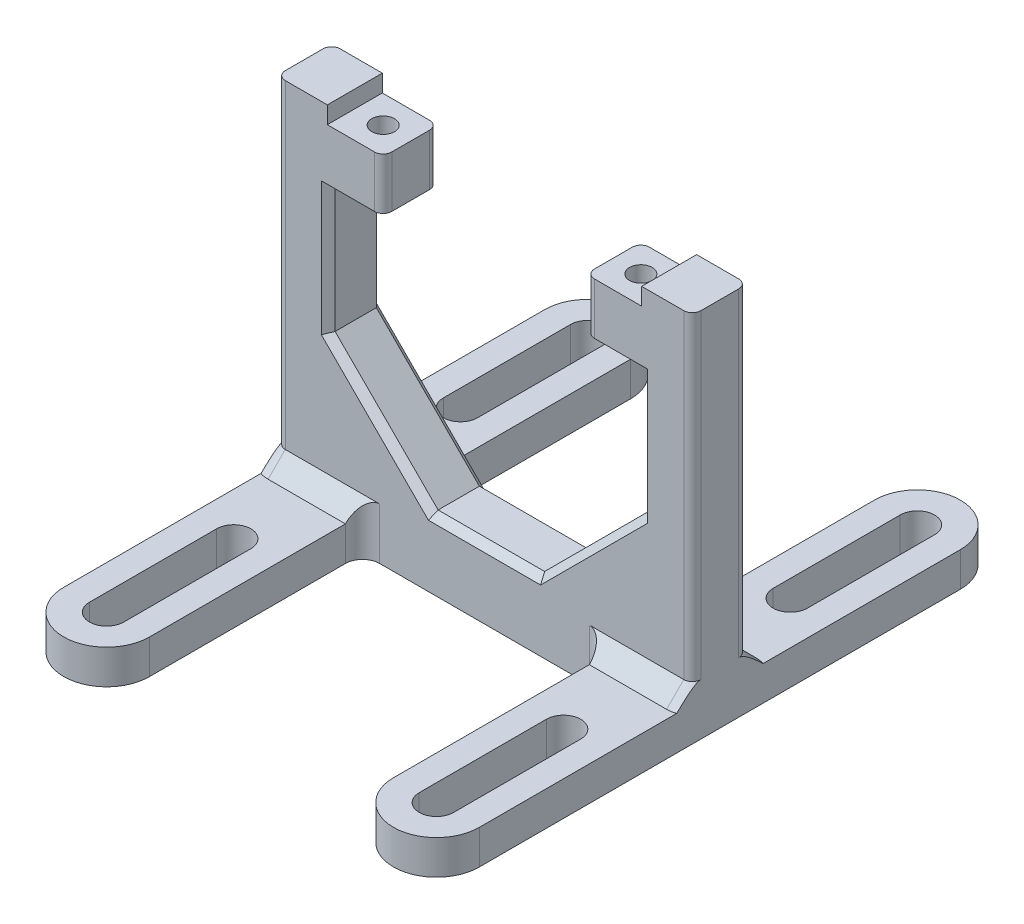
ISO-10303-21;
HEADER;
FILE_DESCRIPTION(('STEP AP214'),'2;1');
FILE_NAME('part.step','',(''),(''),'','','');
FILE_SCHEMA(('AUTOMOTIVE_DESIGN { 1 0 10303 214 1 1 1 1 }'));
ENDSEC;
DATA;
#1=APPLICATION_CONTEXT('core data for automotive mechanical design processes');
#2=APPLICATION_PROTOCOL_DEFINITION('international standard','automotive_design',2000,#1);
#3=PRODUCT_CONTEXT('',#1,'mechanical');
#4=PRODUCT('Part','Part','',(#3));
#5=PRODUCT_RELATED_PRODUCT_CATEGORY('part','',(#4));
#6=PRODUCT_DEFINITION_FORMATION('','',#4);
#7=PRODUCT_DEFINITION_CONTEXT('part definition',#1,'design');
#8=PRODUCT_DEFINITION('design','',#6,#7);
#9=PRODUCT_DEFINITION_SHAPE('','',#8);
#10=(LENGTH_UNIT() NAMED_UNIT(*) SI_UNIT(.MILLI.,.METRE.));
#11=(NAMED_UNIT(*) PLANE_ANGLE_UNIT() SI_UNIT($,.RADIAN.));
#12=(NAMED_UNIT(*) SI_UNIT($,.STERADIAN.) SOLID_ANGLE_UNIT());
#13=UNCERTAINTY_MEASURE_WITH_UNIT(LENGTH_MEASURE(1.E-05),#10,'distance_accuracy_value','');
#14=(GEOMETRIC_REPRESENTATION_CONTEXT(3) GLOBAL_UNCERTAINTY_ASSIGNED_CONTEXT((#13)) GLOBAL_UNIT_ASSIGNED_CONTEXT((#10,
#11,#12)) REPRESENTATION_CONTEXT('',''));
#15=CARTESIAN_POINT('',(0.,0.,0.));
#16=DIRECTION('',(0.,0.,1.));
#17=DIRECTION('',(1.,0.,0.));
#18=AXIS2_PLACEMENT_3D('',#15,#16,#17);
#19=CARTESIAN_POINT('',(-45.5,0.,16.));
#20=DIRECTION('',(0.,-1.,0.));
#21=DIRECTION('',(1.,0.,0.));
#22=AXIS2_PLACEMENT_3D('',#19,#20,#21);
#23=PLANE('',#22);
#24=CARTESIAN_POINT('',(-37.5,0.,8.));
#25=DIRECTION('',(0.,1.,0.));
#26=DIRECTION('',(0.,0.,1.));
#27=AXIS2_PLACEMENT_3D('',#24,#25,#26);
#28=CIRCLE('',#27,3.29999999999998);
#29=CARTESIAN_POINT('',(-37.5,0.,11.3));
#30=VERTEX_POINT('',#29);
#31=EDGE_CURVE('E297',#30,#30,#28,.T.);
#32=ORIENTED_EDGE('',*,*,#31,.F.);
#33=EDGE_LOOP('',(#32));
#34=FACE_BOUND('',#33,.T.);
#35=DIRECTION('',(0.,0.,1.));
#36=VECTOR('',#35,1.);
#37=CARTESIAN_POINT('',(-29.5,0.,-74.5));
#38=LINE('',#37,#36);
#39=CARTESIAN_POINT('',(-29.5,0.,2.5));
#40=VERTEX_POINT('',#39);
#41=CARTESIAN_POINT('',(-29.5,0.,13.5));
#42=VERTEX_POINT('',#41);
#43=EDGE_CURVE('E517',#40,#42,#38,.T.);
#44=ORIENTED_EDGE('',*,*,#43,.F.);
#45=CARTESIAN_POINT('',(-32.,0.,2.5));
#46=DIRECTION('',(0.,-1.,0.));
#47=DIRECTION('',(1.,0.,0.));
#48=AXIS2_PLACEMENT_3D('',#45,#46,#47);
#49=CIRCLE('',#48,2.5);
#50=CARTESIAN_POINT('',(-32.,0.,0.));
#51=VERTEX_POINT('',#50);
#52=EDGE_CURVE('E558',#40,#51,#49,.F.);
#53=ORIENTED_EDGE('',*,*,#52,.T.);
#54=DIRECTION('',(-1.,0.,0.));
#55=VECTOR('',#54,1.);
#56=CARTESIAN_POINT('',(-45.5,0.,0.));
#57=LINE('',#56,#55);
#58=CARTESIAN_POINT('',(-45.75,0.,0.));
#59=VERTEX_POINT('',#58);
#60=EDGE_CURVE('E139',#51,#59,#57,.T.);
#61=ORIENTED_EDGE('',*,*,#60,.T.);
#62=DIRECTION('',(0.,0.,-1.));
#63=VECTOR('',#62,1.);
#64=CARTESIAN_POINT('',(-45.75,0.,16.));
#65=LINE('',#64,#63);
#66=CARTESIAN_POINT('',(-45.75,0.,16.));
#67=VERTEX_POINT('',#66);
#68=EDGE_CURVE('E119',#67,#59,#65,.T.);
#69=ORIENTED_EDGE('',*,*,#68,.F.);
#70=DIRECTION('',(-1.,0.,0.));
#71=VECTOR('',#70,1.);
#72=CARTESIAN_POINT('',(-45.5,0.,16.));
#73=LINE('',#72,#71);
#74=CARTESIAN_POINT('',(-32.,0.,16.));
#75=VERTEX_POINT('',#74);
#76=EDGE_CURVE('E104',#75,#67,#73,.T.);
#77=ORIENTED_EDGE('',*,*,#76,.F.);
#78=CARTESIAN_POINT('',(-32.,0.,13.5));
#79=DIRECTION('',(0.,-1.,0.));
#80=DIRECTION('',(1.,0.,0.));
#81=AXIS2_PLACEMENT_3D('',#78,#79,#80);
#82=CIRCLE('',#81,2.5);
#83=EDGE_CURVE('E555',#75,#42,#82,.F.);
#84=ORIENTED_EDGE('',*,*,#83,.T.);
#85=EDGE_LOOP('',(#44,#53,#61,#69,#77,#84));
#86=FACE_BOUND('',#85,.T.);
#87=ADVANCED_FACE('F42',(#34,#86),#23,.F.);
#88=CARTESIAN_POINT('',(45.5,-15.,16.));
#89=DIRECTION('',(0.,-1.,0.));
#90=DIRECTION('',(1.,0.,0.));
#91=AXIS2_PLACEMENT_3D('',#88,#89,#90);
#92=PLANE('',#91);
#93=DIRECTION('',(-1.,0.,0.));
#94=VECTOR('',#93,1.);
#95=CARTESIAN_POINT('',(45.5,-15.,0.));
#96=LINE('',#95,#94);
#97=CARTESIAN_POINT('',(-32.,-15.,0.));
#98=VERTEX_POINT('',#97);
#99=CARTESIAN_POINT('',(-47.5,-15.,0.));
#100=VERTEX_POINT('',#99);
#101=EDGE_CURVE('E819',#98,#100,#96,.T.);
#102=ORIENTED_EDGE('',*,*,#101,.F.);
#103=CARTESIAN_POINT('',(-32.,-15.,2.5));
#104=DIRECTION('',(0.,-1.,0.));
#105=DIRECTION('',(1.,0.,0.));
#106=AXIS2_PLACEMENT_3D('',#103,#104,#105);
#107=CIRCLE('',#106,2.5);
#108=CARTESIAN_POINT('',(-29.5,-15.,2.5));
#109=VERTEX_POINT('',#108);
#110=EDGE_CURVE('E12',#98,#109,#107,.T.);
#111=ORIENTED_EDGE('',*,*,#110,.T.);
#112=DIRECTION('',(0.,0.,-1.));
#113=VECTOR('',#112,1.);
#114=CARTESIAN_POINT('',(-29.5,-15.,16.));
#115=LINE('',#114,#113);
#116=CARTESIAN_POINT('',(-29.5,-15.,13.5));
#117=VERTEX_POINT('',#116);
#118=EDGE_CURVE('E520',#117,#109,#115,.T.);
#119=ORIENTED_EDGE('',*,*,#118,.F.);
#120=CARTESIAN_POINT('',(-32.,-15.,13.5));
#121=DIRECTION('',(0.,-1.,0.));
#122=DIRECTION('',(1.,0.,0.));
#123=AXIS2_PLACEMENT_3D('',#120,#121,#122);
#124=CIRCLE('',#123,2.5);
#125=CARTESIAN_POINT('',(-32.,-15.,16.));
#126=VERTEX_POINT('',#125);
#127=EDGE_CURVE('E52',#117,#126,#124,.T.);
#128=ORIENTED_EDGE('',*,*,#127,.T.);
#129=DIRECTION('',(-1.,0.,0.));
#130=VECTOR('',#129,1.);
#131=CARTESIAN_POINT('',(45.5,-15.,16.));
#132=LINE('',#131,#130);
#133=CARTESIAN_POINT('',(-47.5,-15.,16.));
#134=VERTEX_POINT('',#133);
#135=EDGE_CURVE('E568',#126,#134,#132,.T.);
#136=ORIENTED_EDGE('',*,*,#135,.T.);
#137=DIRECTION('',(0.707106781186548,0.,-0.707106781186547));
#138=VECTOR('',#137,1.);
#139=CARTESIAN_POINT('',(-45.5,-15.,14.));
#140=LINE('',#139,#138);
#141=CARTESIAN_POINT('',(-45.5,-15.,14.));
#142=VERTEX_POINT('',#141);
#143=EDGE_CURVE('E280',#134,#142,#140,.T.);
#144=ORIENTED_EDGE('',*,*,#143,.T.);
#145=DIRECTION('',(0.,0.,-1.));
#146=VECTOR('',#145,1.);
#147=CARTESIAN_POINT('',(-45.5,-15.,16.));
#148=LINE('',#147,#146);
#149=CARTESIAN_POINT('',(-45.5,-15.,2.));
#150=VERTEX_POINT('',#149);
#151=EDGE_CURVE('E822',#142,#150,#148,.T.);
#152=ORIENTED_EDGE('',*,*,#151,.T.);
#153=DIRECTION('',(0.707106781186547,0.,0.707106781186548));
#154=VECTOR('',#153,1.);
#155=CARTESIAN_POINT('',(-47.5,-15.,0.));
#156=LINE('',#155,#154);
#157=EDGE_CURVE('E274',#150,#100,#156,.F.);
#158=ORIENTED_EDGE('',*,*,#157,.T.);
#159=EDGE_LOOP('',(#102,#111,#119,#128,#136,#144,#152,#158));
#160=FACE_BOUND('',#159,.T.);
#161=CARTESIAN_POINT('',(-37.5,-15.,8.));
#162=DIRECTION('',(0.,-1.,0.));
#163=DIRECTION('',(1.,0.,0.));
#164=AXIS2_PLACEMENT_3D('',#161,#162,#163);
#165=CIRCLE('',#164,3.29999999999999);
#166=CARTESIAN_POINT('',(-34.2,-15.,8.));
#167=VERTEX_POINT('',#166);
#168=EDGE_CURVE('E811',#167,#167,#165,.T.);
#169=ORIENTED_EDGE('',*,*,#168,.F.);
#170=EDGE_LOOP('',(#169));
#171=FACE_BOUND('',#170,.T.);
#172=ADVANCED_FACE('F565',(#160,#171),#92,.T.);
#173=CARTESIAN_POINT('',(-58.,4.99999999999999,2.5));
#174=DIRECTION('',(0.,1.,0.));
#175=DIRECTION('',(-1.,0.,0.));
#176=AXIS2_PLACEMENT_3D('',#173,#174,#175);
#177=CYLINDRICAL_SURFACE('',#176,2.5);
#178=DIRECTION('',(0.,-1.,0.));
#179=VECTOR('',#178,1.);
#180=CARTESIAN_POINT('',(-58.,4.99999999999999,0.));
#181=LINE('',#180,#179);
#182=CARTESIAN_POINT('',(-58.,-88.,0.));
#183=VERTEX_POINT('',#182);
#184=CARTESIAN_POINT('',(-58.,4.99999999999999,0.));
#185=VERTEX_POINT('',#184);
#186=EDGE_CURVE('E185',#183,#185,#181,.F.);
#187=ORIENTED_EDGE('',*,*,#186,.F.);
#188=CARTESIAN_POINT('',(-58.,-88.,2.5));
#189=DIRECTION('',(0.,-1.,0.));
#190=DIRECTION('',(0.,0.,-1.));
#191=AXIS2_PLACEMENT_3D('',#188,#189,#190);
#192=CIRCLE('',#191,2.5);
#193=CARTESIAN_POINT('',(-60.5,-88.,2.5));
#194=VERTEX_POINT('',#193);
#195=EDGE_CURVE('E345',#183,#194,#192,.F.);
#196=ORIENTED_EDGE('',*,*,#195,.T.);
#197=DIRECTION('',(0.,-1.,0.));
#198=VECTOR('',#197,1.);
#199=CARTESIAN_POINT('',(-60.5,-103.,2.5));
#200=LINE('',#199,#198);
#201=CARTESIAN_POINT('',(-60.5,4.99999999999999,2.5));
#202=VERTEX_POINT('',#201);
#203=EDGE_CURVE('E179',#202,#194,#200,.T.);
#204=ORIENTED_EDGE('',*,*,#203,.F.);
#205=CARTESIAN_POINT('',(-58.,4.99999999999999,2.5));
#206=DIRECTION('',(0.,-1.,0.));
#207=DIRECTION('',(1.,0.,0.));
#208=AXIS2_PLACEMENT_3D('',#205,#206,#207);
#209=CIRCLE('',#208,2.5);
#210=EDGE_CURVE('E191',#185,#202,#209,.F.);
#211=ORIENTED_EDGE('',*,*,#210,.F.);
#212=EDGE_LOOP('',(#187,#196,#204,#211));
#213=FACE_BOUND('',#212,.T.);
#214=ADVANCED_FACE('F899',(#213),#177,.T.);
#215=CARTESIAN_POINT('',(-58.,0.,13.5));
#216=DIRECTION('',(0.,-1.,0.));
#217=DIRECTION('',(1.,0.,0.));
#218=AXIS2_PLACEMENT_3D('',#215,#216,#217);
#219=CYLINDRICAL_SURFACE('',#218,2.5);
#220=DIRECTION('',(0.,-1.,0.));
#221=VECTOR('',#220,1.);
#222=CARTESIAN_POINT('',(-60.5,4.99999999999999,13.5));
#223=LINE('',#222,#221);
#224=CARTESIAN_POINT('',(-60.5,-88.,13.5));
#225=VERTEX_POINT('',#224);
#226=CARTESIAN_POINT('',(-60.5,4.99999999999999,13.5));
#227=VERTEX_POINT('',#226);
#228=EDGE_CURVE('E176',#225,#227,#223,.F.);
#229=ORIENTED_EDGE('',*,*,#228,.F.);
#230=CARTESIAN_POINT('',(-58.,-88.,13.5));
#231=DIRECTION('',(0.,-1.,0.));
#232=DIRECTION('',(0.,0.,-1.));
#233=AXIS2_PLACEMENT_3D('',#230,#231,#232);
#234=CIRCLE('',#233,2.5);
#235=CARTESIAN_POINT('',(-58.,-88.,16.));
#236=VERTEX_POINT('',#235);
#237=EDGE_CURVE('E384',#225,#236,#234,.F.);
#238=ORIENTED_EDGE('',*,*,#237,.T.);
#239=DIRECTION('',(0.,-1.,0.));
#240=VECTOR('',#239,1.);
#241=CARTESIAN_POINT('',(-58.,0.,16.));
#242=LINE('',#241,#240);
#243=CARTESIAN_POINT('',(-58.,4.99999999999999,16.));
#244=VERTEX_POINT('',#243);
#245=EDGE_CURVE('E194',#244,#236,#242,.T.);
#246=ORIENTED_EDGE('',*,*,#245,.F.);
#247=CARTESIAN_POINT('',(-58.,4.99999999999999,13.5));
#248=DIRECTION('',(0.,-1.,0.));
#249=DIRECTION('',(1.,0.,0.));
#250=AXIS2_PLACEMENT_3D('',#247,#248,#249);
#251=CIRCLE('',#250,2.5);
#252=EDGE_CURVE('E188',#227,#244,#251,.F.);
#253=ORIENTED_EDGE('',*,*,#252,.F.);
#254=EDGE_LOOP('',(#229,#238,#246,#253));
#255=FACE_BOUND('',#254,.T.);
#256=ADVANCED_FACE('F841',(#255),#219,.T.);
#257=CARTESIAN_POINT('',(37.5,0.,7.99999999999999));
#258=DIRECTION('',(0.,1.,0.));
#259=DIRECTION('',(0.,0.,1.));
#260=AXIS2_PLACEMENT_3D('',#257,#258,#259);
#261=CIRCLE('',#260,3.29999999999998);
#262=CARTESIAN_POINT('',(37.5,0.,11.3));
#263=VERTEX_POINT('',#262);
#264=EDGE_CURVE('E814',#263,#263,#261,.T.);
#265=ORIENTED_EDGE('',*,*,#264,.F.);
#266=EDGE_LOOP('',(#265));
#267=FACE_BOUND('',#266,.T.);
#268=DIRECTION('',(0.,0.,1.));
#269=VECTOR('',#268,1.);
#270=CARTESIAN_POINT('',(29.5,0.,-74.5));
#271=LINE('',#270,#269);
#272=CARTESIAN_POINT('',(29.5,0.,2.5));
#273=VERTEX_POINT('',#272);
#274=CARTESIAN_POINT('',(29.5,0.,13.5));
#275=VERTEX_POINT('',#274);
#276=EDGE_CURVE('E591',#273,#275,#271,.T.);
#277=ORIENTED_EDGE('',*,*,#276,.T.);
#278=CARTESIAN_POINT('',(32.,0.,13.5));
#279=DIRECTION('',(0.,-1.,0.));
#280=DIRECTION('',(1.,0.,0.));
#281=AXIS2_PLACEMENT_3D('',#278,#279,#280);
#282=CIRCLE('',#281,2.5);
#283=CARTESIAN_POINT('',(32.,0.,16.));
#284=VERTEX_POINT('',#283);
#285=EDGE_CURVE('E99',#275,#284,#282,.F.);
#286=ORIENTED_EDGE('',*,*,#285,.T.);
#287=CARTESIAN_POINT('',(45.75,0.,16.));
#288=VERTEX_POINT('',#287);
#289=EDGE_CURVE('E90',#288,#284,#73,.T.);
#290=ORIENTED_EDGE('',*,*,#289,.F.);
#291=DIRECTION('',(0.,0.,-1.));
#292=VECTOR('',#291,1.);
#293=CARTESIAN_POINT('',(45.75,0.,16.));
#294=LINE('',#293,#292);
#295=CARTESIAN_POINT('',(45.75,0.,0.));
#296=VERTEX_POINT('',#295);
#297=EDGE_CURVE('E46',#288,#296,#294,.T.);
#298=ORIENTED_EDGE('',*,*,#297,.T.);
#299=CARTESIAN_POINT('',(32.,0.,0.));
#300=VERTEX_POINT('',#299);
#301=EDGE_CURVE('E152',#296,#300,#57,.T.);
#302=ORIENTED_EDGE('',*,*,#301,.T.);
#303=CARTESIAN_POINT('',(32.,0.,2.5));
#304=DIRECTION('',(0.,-1.,0.));
#305=DIRECTION('',(1.,0.,0.));
#306=AXIS2_PLACEMENT_3D('',#303,#304,#305);
#307=CIRCLE('',#306,2.5);
#308=EDGE_CURVE('E528',#300,#273,#307,.F.);
#309=ORIENTED_EDGE('',*,*,#308,.T.);
#310=EDGE_LOOP('',(#277,#286,#290,#298,#302,#309));
#311=FACE_BOUND('',#310,.T.);
#312=ADVANCED_FACE('F93',(#267,#311),#23,.F.);
#313=CARTESIAN_POINT('',(0.,0.,16.));
#314=DIRECTION('',(0.,0.,-1.));
#315=DIRECTION('',(-1.,0.,0.));
#316=AXIS2_PLACEMENT_3D('',#313,#314,#315);
#317=PLANE('',#316);
#318=ORIENTED_EDGE('',*,*,#289,.T.);
#319=DIRECTION('',(0.,1.,0.));
#320=VECTOR('',#319,1.);
#321=CARTESIAN_POINT('',(32.,0.,16.));
#322=LINE('',#321,#320);
#323=CARTESIAN_POINT('',(32.,-15.,16.));
#324=VERTEX_POINT('',#323);
#325=EDGE_CURVE('E535',#284,#324,#322,.F.);
#326=ORIENTED_EDGE('',*,*,#325,.T.);
#327=CARTESIAN_POINT('',(47.5,-15.,16.));
#328=VERTEX_POINT('',#327);
#329=EDGE_CURVE('E577',#328,#324,#132,.T.);
#330=ORIENTED_EDGE('',*,*,#329,.F.);
#331=DIRECTION('',(0.,-1.,0.));
#332=VECTOR('',#331,1.);
#333=CARTESIAN_POINT('',(47.5,-53.0000000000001,16.));
#334=LINE('',#333,#332);
#335=CARTESIAN_POINT('',(47.5,-53.8284271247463,16.));
#336=VERTEX_POINT('',#335);
#337=EDGE_CURVE('E268',#328,#336,#334,.T.);
#338=ORIENTED_EDGE('',*,*,#337,.T.);
#339=DIRECTION('',(-0.707106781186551,-0.707106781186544,0.));
#340=VECTOR('',#339,1.);
#341=CARTESIAN_POINT('',(50.6642135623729,-50.6642135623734,16.));
#342=LINE('',#341,#340);
#343=CARTESIAN_POINT('',(16.328427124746,-85.,16.));
#344=VERTEX_POINT('',#343);
#345=EDGE_CURVE('E265',#336,#344,#342,.T.);
#346=ORIENTED_EDGE('',*,*,#345,.T.);
#347=DIRECTION('',(-1.,0.,0.));
#348=VECTOR('',#347,1.);
#349=CARTESIAN_POINT('',(-15.5000000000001,-85.,16.));
#350=LINE('',#349,#348);
#351=CARTESIAN_POINT('',(-16.3284271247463,-85.,16.));
#352=VERTEX_POINT('',#351);
#353=EDGE_CURVE('E262',#344,#352,#350,.T.);
#354=ORIENTED_EDGE('',*,*,#353,.T.);
#355=DIRECTION('',(-0.707106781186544,0.707106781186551,0.));
#356=VECTOR('',#355,1.);
#357=CARTESIAN_POINT('',(-50.6642135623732,-50.6642135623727,16.));
#358=LINE('',#357,#356);
#359=CARTESIAN_POINT('',(-47.5,-53.828427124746,16.));
#360=VERTEX_POINT('',#359);
#361=EDGE_CURVE('E256',#352,#360,#358,.T.);
#362=ORIENTED_EDGE('',*,*,#361,.T.);
#363=DIRECTION('',(0.,1.,0.));
#364=VECTOR('',#363,1.);
#365=CARTESIAN_POINT('',(-47.5,-15.,16.));
#366=LINE('',#365,#364);
#367=EDGE_CURVE('E259',#360,#134,#366,.T.);
#368=ORIENTED_EDGE('',*,*,#367,.T.);
#369=ORIENTED_EDGE('',*,*,#135,.F.);
#370=DIRECTION('',(0.,-1.,0.));
#371=VECTOR('',#370,1.);
#372=CARTESIAN_POINT('',(-32.,0.,16.));
#373=LINE('',#372,#371);
#374=EDGE_CURVE('E532',#126,#75,#373,.F.);
#375=ORIENTED_EDGE('',*,*,#374,.T.);
#376=ORIENTED_EDGE('',*,*,#76,.T.);
#377=DIRECTION('',(0.,1.,0.));
#378=VECTOR('',#377,1.);
#379=CARTESIAN_POINT('',(-45.75,0.,16.));
#380=LINE('',#379,#378);
#381=CARTESIAN_POINT('',(-45.75,4.99999999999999,16.));
#382=VERTEX_POINT('',#381);
#383=EDGE_CURVE('E103',#67,#382,#380,.T.);
#384=ORIENTED_EDGE('',*,*,#383,.T.);
#385=DIRECTION('',(-1.,0.,0.));
#386=VECTOR('',#385,1.);
#387=CARTESIAN_POINT('',(-45.5,4.99999999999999,16.));
#388=LINE('',#387,#386);
#389=EDGE_CURVE('E136',#382,#244,#388,.T.);
#390=ORIENTED_EDGE('',*,*,#389,.T.);
#391=ORIENTED_EDGE('',*,*,#245,.T.);
#392=DIRECTION('',(1.,0.,0.));
#393=VECTOR('',#392,1.);
#394=CARTESIAN_POINT('',(-30.5,-88.,16.));
#395=LINE('',#394,#393);
#396=CARTESIAN_POINT('',(-30.5,-88.,16.));
#397=VERTEX_POINT('',#396);
#398=EDGE_CURVE('E378',#236,#397,#395,.T.);
#399=ORIENTED_EDGE('',*,*,#398,.T.);
#400=DIRECTION('',(0.,-1.,0.));
#401=VECTOR('',#400,1.);
#402=CARTESIAN_POINT('',(-30.5,0.,16.));
#403=LINE('',#402,#401);
#404=CARTESIAN_POINT('',(-30.5,-103.,16.));
#405=VERTEX_POINT('',#404);
#406=EDGE_CURVE('E318',#397,#405,#403,.T.);
#407=ORIENTED_EDGE('',*,*,#406,.T.);
#408=DIRECTION('',(1.,0.,0.));
#409=VECTOR('',#408,1.);
#410=CARTESIAN_POINT('',(60.5,-103.,16.));
#411=LINE('',#410,#409);
#412=CARTESIAN_POINT('',(30.5,-103.,16.));
#413=VERTEX_POINT('',#412);
#414=EDGE_CURVE('E146',#405,#413,#411,.T.);
#415=ORIENTED_EDGE('',*,*,#414,.T.);
#416=DIRECTION('',(0.,1.,0.));
#417=VECTOR('',#416,1.);
#418=CARTESIAN_POINT('',(30.5,0.,16.));
#419=LINE('',#418,#417);
#420=CARTESIAN_POINT('',(30.5,-88.,16.));
#421=VERTEX_POINT('',#420);
#422=EDGE_CURVE('E321',#413,#421,#419,.T.);
#423=ORIENTED_EDGE('',*,*,#422,.T.);
#424=DIRECTION('',(1.,0.,0.));
#425=VECTOR('',#424,1.);
#426=CARTESIAN_POINT('',(0.,-88.,16.));
#427=LINE('',#426,#425);
#428=CARTESIAN_POINT('',(58.,-88.,16.));
#429=VERTEX_POINT('',#428);
#430=EDGE_CURVE('E381',#421,#429,#427,.T.);
#431=ORIENTED_EDGE('',*,*,#430,.T.);
#432=DIRECTION('',(0.,1.,0.));
#433=VECTOR('',#432,1.);
#434=CARTESIAN_POINT('',(58.,0.,16.));
#435=LINE('',#434,#433);
#436=CARTESIAN_POINT('',(58.,5.,16.));
#437=VERTEX_POINT('',#436);
#438=EDGE_CURVE('E197',#429,#437,#435,.T.);
#439=ORIENTED_EDGE('',*,*,#438,.T.);
#440=DIRECTION('',(-1.,0.,0.));
#441=VECTOR('',#440,1.);
#442=CARTESIAN_POINT('',(45.5,5.,16.));
#443=LINE('',#442,#441);
#444=CARTESIAN_POINT('',(45.75,5.,16.));
#445=VERTEX_POINT('',#444);
#446=EDGE_CURVE('E111',#437,#445,#443,.T.);
#447=ORIENTED_EDGE('',*,*,#446,.T.);
#448=DIRECTION('',(0.,-1.,0.));
#449=VECTOR('',#448,1.);
#450=CARTESIAN_POINT('',(45.75,0.,16.));
#451=LINE('',#450,#449);
#452=EDGE_CURVE('E107',#445,#288,#451,.T.);
#453=ORIENTED_EDGE('',*,*,#452,.T.);
#454=EDGE_LOOP('',(#318,#326,#330,#338,#346,#354,#362,#368,#369,#375,#376,#384,#390,#391,#399,
#407,#415,#423,#431,#439,#447,#453));
#455=FACE_BOUND('',#454,.T.);
#456=ADVANCED_FACE('F108',(#455),#317,.F.);
#457=CARTESIAN_POINT('',(0.,0.,0.));
#458=DIRECTION('',(0.,0.,-1.));
#459=DIRECTION('',(-1.,0.,0.));
#460=AXIS2_PLACEMENT_3D('',#457,#458,#459);
#461=PLANE('',#460);
#462=CARTESIAN_POINT('',(47.5,-15.,0.));
#463=VERTEX_POINT('',#462);
#464=CARTESIAN_POINT('',(32.,-15.,0.));
#465=VERTEX_POINT('',#464);
#466=EDGE_CURVE('E578',#463,#465,#96,.T.);
#467=ORIENTED_EDGE('',*,*,#466,.T.);
#468=DIRECTION('',(0.,-1.,0.));
#469=VECTOR('',#468,1.);
#470=CARTESIAN_POINT('',(32.,0.,0.));
#471=LINE('',#470,#469);
#472=EDGE_CURVE('E546',#465,#300,#471,.F.);
#473=ORIENTED_EDGE('',*,*,#472,.T.);
#474=ORIENTED_EDGE('',*,*,#301,.F.);
#475=DIRECTION('',(0.,-1.,0.));
#476=VECTOR('',#475,1.);
#477=CARTESIAN_POINT('',(45.75,0.,0.));
#478=LINE('',#477,#476);
#479=CARTESIAN_POINT('',(45.75,5.,0.));
#480=VERTEX_POINT('',#479);
#481=EDGE_CURVE('E117',#480,#296,#478,.T.);
#482=ORIENTED_EDGE('',*,*,#481,.F.);
#483=DIRECTION('',(-1.,0.,0.));
#484=VECTOR('',#483,1.);
#485=CARTESIAN_POINT('',(45.5,5.,0.));
#486=LINE('',#485,#484);
#487=CARTESIAN_POINT('',(58.,5.,0.));
#488=VERTEX_POINT('',#487);
#489=EDGE_CURVE('E115',#488,#480,#486,.T.);
#490=ORIENTED_EDGE('',*,*,#489,.F.);
#491=DIRECTION('',(0.,1.,0.));
#492=VECTOR('',#491,1.);
#493=CARTESIAN_POINT('',(58.,-103.,0.));
#494=LINE('',#493,#492);
#495=CARTESIAN_POINT('',(58.,-88.,0.));
#496=VERTEX_POINT('',#495);
#497=EDGE_CURVE('E182',#488,#496,#494,.F.);
#498=ORIENTED_EDGE('',*,*,#497,.T.);
#499=DIRECTION('',(-1.,0.,0.));
#500=VECTOR('',#499,1.);
#501=CARTESIAN_POINT('',(30.5,-88.,0.));
#502=LINE('',#501,#500);
#503=CARTESIAN_POINT('',(30.5,-88.,0.));
#504=VERTEX_POINT('',#503);
#505=EDGE_CURVE('E354',#496,#504,#502,.T.);
#506=ORIENTED_EDGE('',*,*,#505,.T.);
#507=DIRECTION('',(0.,1.,0.));
#508=VECTOR('',#507,1.);
#509=CARTESIAN_POINT('',(30.5,-103.,0.));
#510=LINE('',#509,#508);
#511=CARTESIAN_POINT('',(30.5,-103.,0.));
#512=VERTEX_POINT('',#511);
#513=EDGE_CURVE('E312',#504,#512,#510,.F.);
#514=ORIENTED_EDGE('',*,*,#513,.T.);
#515=DIRECTION('',(1.,0.,0.));
#516=VECTOR('',#515,1.);
#517=CARTESIAN_POINT('',(60.5,-103.,0.));
#518=LINE('',#517,#516);
#519=CARTESIAN_POINT('',(-30.5,-103.,0.));
#520=VERTEX_POINT('',#519);
#521=EDGE_CURVE('E157',#520,#512,#518,.T.);
#522=ORIENTED_EDGE('',*,*,#521,.F.);
#523=DIRECTION('',(0.,-1.,0.));
#524=VECTOR('',#523,1.);
#525=CARTESIAN_POINT('',(-30.5,-93.,0.));
#526=LINE('',#525,#524);
#527=CARTESIAN_POINT('',(-30.5,-88.,0.));
#528=VERTEX_POINT('',#527);
#529=EDGE_CURVE('E315',#520,#528,#526,.F.);
#530=ORIENTED_EDGE('',*,*,#529,.T.);
#531=DIRECTION('',(-1.,0.,0.));
#532=VECTOR('',#531,1.);
#533=CARTESIAN_POINT('',(0.,-88.,0.));
#534=LINE('',#533,#532);
#535=EDGE_CURVE('E357',#528,#183,#534,.T.);
#536=ORIENTED_EDGE('',*,*,#535,.T.);
#537=ORIENTED_EDGE('',*,*,#186,.T.);
#538=DIRECTION('',(-1.,0.,0.));
#539=VECTOR('',#538,1.);
#540=CARTESIAN_POINT('',(-45.5,4.99999999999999,0.));
#541=LINE('',#540,#539);
#542=CARTESIAN_POINT('',(-45.75,4.99999999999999,0.));
#543=VERTEX_POINT('',#542);
#544=EDGE_CURVE('E154',#543,#185,#541,.T.);
#545=ORIENTED_EDGE('',*,*,#544,.F.);
#546=DIRECTION('',(0.,1.,0.));
#547=VECTOR('',#546,1.);
#548=CARTESIAN_POINT('',(-45.75,0.,0.));
#549=LINE('',#548,#547);
#550=EDGE_CURVE('E135',#59,#543,#549,.T.);
#551=ORIENTED_EDGE('',*,*,#550,.F.);
#552=ORIENTED_EDGE('',*,*,#60,.F.);
#553=DIRECTION('',(0.,1.,0.));
#554=VECTOR('',#553,1.);
#555=CARTESIAN_POINT('',(-32.,-15.,0.));
#556=LINE('',#555,#554);
#557=EDGE_CURVE('E543',#51,#98,#556,.F.);
#558=ORIENTED_EDGE('',*,*,#557,.T.);
#559=ORIENTED_EDGE('',*,*,#101,.T.);
#560=DIRECTION('',(0.,-1.,0.));
#561=VECTOR('',#560,1.);
#562=CARTESIAN_POINT('',(-47.5,0.,0.));
#563=LINE('',#562,#561);
#564=CARTESIAN_POINT('',(-47.5,-53.828427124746,0.));
#565=VERTEX_POINT('',#564);
#566=EDGE_CURVE('E220',#100,#565,#563,.T.);
#567=ORIENTED_EDGE('',*,*,#566,.T.);
#568=DIRECTION('',(0.707106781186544,-0.707106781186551,0.));
#569=VECTOR('',#568,1.);
#570=CARTESIAN_POINT('',(-16.9142135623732,-84.4142135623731,0.));
#571=LINE('',#570,#569);
#572=CARTESIAN_POINT('',(-16.3284271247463,-85.,0.));
#573=VERTEX_POINT('',#572);
#574=EDGE_CURVE('E211',#565,#573,#571,.T.);
#575=ORIENTED_EDGE('',*,*,#574,.T.);
#576=DIRECTION('',(1.,0.,0.));
#577=VECTOR('',#576,1.);
#578=CARTESIAN_POINT('',(0.,-85.,0.));
#579=LINE('',#578,#577);
#580=CARTESIAN_POINT('',(16.328427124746,-85.,0.));
#581=VERTEX_POINT('',#580);
#582=EDGE_CURVE('E214',#573,#581,#579,.T.);
#583=ORIENTED_EDGE('',*,*,#582,.T.);
#584=DIRECTION('',(0.707106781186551,0.707106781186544,0.));
#585=VECTOR('',#584,1.);
#586=CARTESIAN_POINT('',(46.9142135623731,-54.4142135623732,0.));
#587=LINE('',#586,#585);
#588=CARTESIAN_POINT('',(47.5,-53.8284271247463,0.));
#589=VERTEX_POINT('',#588);
#590=EDGE_CURVE('E217',#581,#589,#587,.T.);
#591=ORIENTED_EDGE('',*,*,#590,.T.);
#592=DIRECTION('',(0.,1.,0.));
#593=VECTOR('',#592,1.);
#594=CARTESIAN_POINT('',(47.5,0.,0.));
#595=LINE('',#594,#593);
#596=EDGE_CURVE('E223',#589,#463,#595,.T.);
#597=ORIENTED_EDGE('',*,*,#596,.T.);
#598=EDGE_LOOP('',(#467,#473,#474,#482,#490,#498,#506,#514,#522,#530,#536,#537,#545,#551,#552,
#558,#559,#567,#575,#583,#591,#597));
#599=FACE_BOUND('',#598,.T.);
#600=ADVANCED_FACE('F886',(#599),#461,.T.);
#601=CARTESIAN_POINT('',(45.75,0.,16.));
#602=DIRECTION('',(1.,0.,0.));
#603=DIRECTION('',(0.,1.,0.));
#604=AXIS2_PLACEMENT_3D('',#601,#602,#603);
#605=PLANE('',#604);
#606=ORIENTED_EDGE('',*,*,#481,.T.);
#607=ORIENTED_EDGE('',*,*,#297,.F.);
#608=ORIENTED_EDGE('',*,*,#452,.F.);
#609=DIRECTION('',(0.,0.,-1.));
#610=VECTOR('',#609,1.);
#611=CARTESIAN_POINT('',(45.75,5.,16.));
#612=LINE('',#611,#610);
#613=EDGE_CURVE('E141',#445,#480,#612,.T.);
#614=ORIENTED_EDGE('',*,*,#613,.T.);
#615=EDGE_LOOP('',(#606,#607,#608,#614));
#616=FACE_BOUND('',#615,.T.);
#617=ADVANCED_FACE('F44',(#616),#605,.F.);
#618=CARTESIAN_POINT('',(-45.75,0.,16.));
#619=DIRECTION('',(-1.,0.,0.));
#620=DIRECTION('',(0.,-1.,0.));
#621=AXIS2_PLACEMENT_3D('',#618,#619,#620);
#622=PLANE('',#621);
#623=ORIENTED_EDGE('',*,*,#550,.T.);
#624=DIRECTION('',(0.,0.,-1.));
#625=VECTOR('',#624,1.);
#626=CARTESIAN_POINT('',(-45.75,4.99999999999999,16.));
#627=LINE('',#626,#625);
#628=EDGE_CURVE('E124',#382,#543,#627,.T.);
#629=ORIENTED_EDGE('',*,*,#628,.F.);
#630=ORIENTED_EDGE('',*,*,#383,.F.);
#631=ORIENTED_EDGE('',*,*,#68,.T.);
#632=EDGE_LOOP('',(#623,#629,#630,#631));
#633=FACE_BOUND('',#632,.T.);
#634=ADVANCED_FACE('F889',(#633),#622,.F.);
#635=CARTESIAN_POINT('',(-45.5,4.99999999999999,16.));
#636=DIRECTION('',(0.,-1.,0.));
#637=DIRECTION('',(1.,0.,0.));
#638=AXIS2_PLACEMENT_3D('',#635,#636,#637);
#639=PLANE('',#638);
#640=ORIENTED_EDGE('',*,*,#544,.T.);
#641=ORIENTED_EDGE('',*,*,#210,.T.);
#642=DIRECTION('',(0.,0.,-1.));
#643=VECTOR('',#642,1.);
#644=CARTESIAN_POINT('',(-60.5,4.99999999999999,16.));
#645=LINE('',#644,#643);
#646=EDGE_CURVE('E131',#227,#202,#645,.T.);
#647=ORIENTED_EDGE('',*,*,#646,.F.);
#648=ORIENTED_EDGE('',*,*,#252,.T.);
#649=ORIENTED_EDGE('',*,*,#389,.F.);
#650=ORIENTED_EDGE('',*,*,#628,.T.);
#651=EDGE_LOOP('',(#640,#641,#647,#648,#649,#650));
#652=FACE_BOUND('',#651,.T.);
#653=ADVANCED_FACE('F890',(#652),#639,.F.);
#654=CARTESIAN_POINT('',(-60.5,4.99999999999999,16.));
#655=DIRECTION('',(1.,0.,0.));
#656=DIRECTION('',(0.,1.,0.));
#657=AXIS2_PLACEMENT_3D('',#654,#655,#656);
#658=PLANE('',#657);
#659=DIRECTION('',(0.,0.,-1.));
#660=VECTOR('',#659,1.);
#661=CARTESIAN_POINT('',(-60.5,-103.,16.));
#662=LINE('',#661,#660);
#663=CARTESIAN_POINT('',(-60.5,-103.,78.));
#664=VERTEX_POINT('',#663);
#665=CARTESIAN_POINT('',(-60.5,-103.,-62.));
#666=VERTEX_POINT('',#665);
#667=EDGE_CURVE('E163',#664,#666,#662,.T.);
#668=ORIENTED_EDGE('',*,*,#667,.F.);
#669=DIRECTION('',(0.,-1.,0.));
#670=VECTOR('',#669,1.);
#671=CARTESIAN_POINT('',(-60.5,-93.,78.));
#672=LINE('',#671,#670);
#673=CARTESIAN_POINT('',(-60.5,-93.,78.));
#674=VERTEX_POINT('',#673);
#675=EDGE_CURVE('E790',#674,#664,#672,.T.);
#676=ORIENTED_EDGE('',*,*,#675,.F.);
#677=DIRECTION('',(0.,0.,-1.));
#678=VECTOR('',#677,1.);
#679=CARTESIAN_POINT('',(-60.5,-93.,78.));
#680=LINE('',#679,#678);
#681=CARTESIAN_POINT('',(-60.5,-93.,20.5710678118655));
#682=VERTEX_POINT('',#681);
#683=EDGE_CURVE('E780',#674,#682,#680,.T.);
#684=ORIENTED_EDGE('',*,*,#683,.T.);
#685=CARTESIAN_POINT('',(-60.5,-93.,20.5710678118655));
#686=CARTESIAN_POINT('',(-60.5,-92.8816974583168,20.445585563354));
#687=CARTESIAN_POINT('',(-60.5,-92.7635763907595,20.3199320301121));
#688=CARTESIAN_POINT('',(-60.5,-92.5277679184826,20.0682165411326));
#689=CARTESIAN_POINT('',(-60.5,-92.4100805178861,19.9421545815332));
#690=CARTESIAN_POINT('',(-60.5,-92.0577079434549,19.5631852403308));
#691=CARTESIAN_POINT('',(-60.5,-91.8237833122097,19.3095694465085));
#692=CARTESIAN_POINT('',(-60.5,-91.3589289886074,18.7998175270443));
#693=CARTESIAN_POINT('',(-60.5,-91.1279979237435,18.5436826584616));
#694=CARTESIAN_POINT('',(-60.5,-90.7849042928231,18.1565800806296));
#695=CARTESIAN_POINT('',(-60.5,-90.6710973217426,18.0270707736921));
#696=CARTESIAN_POINT('',(-60.5,-90.4448758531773,17.7668426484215));
#697=CARTESIAN_POINT('',(-60.5,-90.3324613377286,17.6361238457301));
#698=CARTESIAN_POINT('',(-60.5,-90.0970708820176,17.3586331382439));
#699=CARTESIAN_POINT('',(-60.5,-89.9743021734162,17.2116849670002));
#700=CARTESIAN_POINT('',(-60.5,-89.731700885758,16.9153403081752));
#701=CARTESIAN_POINT('',(-60.5,-89.6118687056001,16.7659434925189));
#702=CARTESIAN_POINT('',(-60.5,-89.3759255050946,16.4634109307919));
#703=CARTESIAN_POINT('',(-60.5,-89.259828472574,16.3102642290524));
#704=CARTESIAN_POINT('',(-60.5,-89.0336385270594,15.9996002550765));
#705=CARTESIAN_POINT('',(-60.5,-88.9235439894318,15.8420841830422));
#706=CARTESIAN_POINT('',(-60.5,-88.7546188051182,15.5851327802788));
#707=CARTESIAN_POINT('',(-60.5,-88.6928725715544,15.4876212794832));
#708=CARTESIAN_POINT('',(-60.5,-88.5737310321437,15.2899865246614));
#709=CARTESIAN_POINT('',(-60.5,-88.5163345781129,15.189863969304));
#710=CARTESIAN_POINT('',(-60.5,-88.4077315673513,14.9873297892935));
#711=CARTESIAN_POINT('',(-60.5,-88.3564786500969,14.8849432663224));
#712=CARTESIAN_POINT('',(-60.5,-88.261527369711,14.6766952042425));
#713=CARTESIAN_POINT('',(-60.5,-88.2178264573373,14.5708348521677));
#714=CARTESIAN_POINT('',(-60.5,-88.1516079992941,14.3866322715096));
#715=CARTESIAN_POINT('',(-60.5,-88.1266189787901,14.3091836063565));
#716=CARTESIAN_POINT('',(-60.5,-88.082688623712,14.1526254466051));
#717=CARTESIAN_POINT('',(-60.5,-88.0637430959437,14.0735171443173));
#718=CARTESIAN_POINT('',(-60.5,-88.0325576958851,13.9125270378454));
#719=CARTESIAN_POINT('',(-60.5,-88.0204398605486,13.830620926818));
#720=CARTESIAN_POINT('',(-60.5,-88.0082251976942,13.7070854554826));
#721=CARTESIAN_POINT('',(-60.5,-88.0051472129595,13.6657359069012));
#722=CARTESIAN_POINT('',(-60.5,-88.0010322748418,13.5829266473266));
#723=CARTESIAN_POINT('',(-60.5,-87.9999957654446,13.5414669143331));
#724=CARTESIAN_POINT('',(-60.5,-88.,13.5));
#725=B_SPLINE_CURVE_WITH_KNOTS('',3,(#685,#686,#687,#688,#689,#690,#691,#692,#693,#694,#695,
#696,#697,#698,#699,#700,#701,#702,#703,#704,#705,#706,#707,#708,#709,#710,#711,#712,#713,#714,
#715,#716,#717,#718,#719,#720,#721,#722,#723,#724),.UNSPECIFIED.,.F.,.F.,(4,2,2,2,2,2,2,2,2,2,2,
2,2,2,2,2,2,2,2,4),(0.,0.517369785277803,1.03474447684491,2.06980361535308,3.10437009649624,
3.62158805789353,4.13879933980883,4.71322251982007,5.28772330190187,5.86417113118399,
6.4404621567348,6.78663140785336,7.13270896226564,7.47598406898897,7.81914307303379,
8.06308084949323,8.30684900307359,8.5548462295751,8.67919335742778,8.80356752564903),.UNSPECIFIED.);
#726=EDGE_CURVE('E493',#682,#225,#725,.T.);
#727=ORIENTED_EDGE('',*,*,#726,.T.);
#728=ORIENTED_EDGE('',*,*,#228,.T.);
#729=ORIENTED_EDGE('',*,*,#646,.T.);
#730=ORIENTED_EDGE('',*,*,#203,.T.);
#731=CARTESIAN_POINT('',(-60.5,-88.,2.5));
#732=CARTESIAN_POINT('',(-60.5,-87.9999351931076,2.42301140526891));
#733=CARTESIAN_POINT('',(-60.5,-88.0035548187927,2.34606288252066));
#734=CARTESIAN_POINT('',(-60.5,-88.0176507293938,2.19295387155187));
#735=CARTESIAN_POINT('',(-60.5,-88.0281125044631,2.116792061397));
#736=CARTESIAN_POINT('',(-60.5,-88.055119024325,1.96710550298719));
#737=CARTESIAN_POINT('',(-60.5,-88.0715413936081,1.89355828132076));
#738=CARTESIAN_POINT('',(-60.5,-88.1097486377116,1.74785186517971));
#739=CARTESIAN_POINT('',(-60.5,-88.1315362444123,1.67569339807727));
#740=CARTESIAN_POINT('',(-60.5,-88.2080987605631,1.44866363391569));
#741=CARTESIAN_POINT('',(-60.5,-88.2714575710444,1.29668390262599));
#742=CARTESIAN_POINT('',(-60.5,-88.4127232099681,0.99963131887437));
#743=CARTESIAN_POINT('',(-60.5,-88.490656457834,0.854571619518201));
#744=CARTESIAN_POINT('',(-60.5,-88.6585395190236,0.565956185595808));
#745=CARTESIAN_POINT('',(-60.5,-88.7487735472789,0.422567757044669));
#746=CARTESIAN_POINT('',(-60.5,-88.8892079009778,0.211009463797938));
#747=CARTESIAN_POINT('',(-60.5,-88.9368470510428,0.141103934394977));
#748=CARTESIAN_POINT('',(-60.5,-89.0335614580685,0.00229285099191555));
#749=CARTESIAN_POINT('',(-60.5,-89.0826366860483,-0.066612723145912));
#750=CARTESIAN_POINT('',(-60.5,-89.2085462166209,-0.240174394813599));
#751=CARTESIAN_POINT('',(-60.5,-89.2861900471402,-0.344242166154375));
#752=CARTESIAN_POINT('',(-60.5,-89.4436583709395,-0.550718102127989));
#753=CARTESIAN_POINT('',(-60.5,-89.5234830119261,-0.6531261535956));
#754=CARTESIAN_POINT('',(-60.5,-89.7655432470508,-0.958371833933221));
#755=CARTESIAN_POINT('',(-60.5,-89.9303303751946,-1.15918398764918));
#756=CARTESIAN_POINT('',(-60.5,-90.2645364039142,-1.55739393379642));
#757=CARTESIAN_POINT('',(-60.5,-90.4339618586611,-1.75478617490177));
#758=CARTESIAN_POINT('',(-60.5,-90.7758282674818,-2.1468886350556));
#759=CARTESIAN_POINT('',(-60.5,-90.9482688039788,-2.34159921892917));
#760=CARTESIAN_POINT('',(-60.5,-91.2760252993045,-2.70752394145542));
#761=CARTESIAN_POINT('',(-60.5,-91.4311130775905,-2.87894308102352));
#762=CARTESIAN_POINT('',(-60.5,-91.7426113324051,-3.22058690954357));
#763=CARTESIAN_POINT('',(-60.5,-91.8990218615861,-3.39081155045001));
#764=CARTESIAN_POINT('',(-60.5,-92.2124043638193,-3.72981127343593));
#765=CARTESIAN_POINT('',(-60.5,-92.3693733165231,-3.89858915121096));
#766=CARTESIAN_POINT('',(-60.5,-92.6841238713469,-4.23536620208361));
#767=CARTESIAN_POINT('',(-60.5,-92.8419054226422,-4.40336542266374));
#768=CARTESIAN_POINT('',(-60.5,-93.,-4.57106781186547));
#769=B_SPLINE_CURVE_WITH_KNOTS('',3,(#731,#732,#733,#734,#735,#736,#737,#738,#739,#740,#741,
#742,#743,#744,#745,#746,#747,#748,#749,#750,#751,#752,#753,#754,#755,#756,#757,#758,#759,#760,
#761,#762,#763,#764,#765,#766,#767,#768),.UNSPECIFIED.,.F.,.F.,(4,2,2,2,2,2,2,2,2,2,2,2,2,2,2,2,
2,2,4),(0.,0.230816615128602,0.461145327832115,0.68699045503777,0.912950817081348,
1.4055940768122,1.89913917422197,2.40708126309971,2.6608549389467,2.91462349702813,
3.3041071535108,3.6936172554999,4.47281276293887,5.25317278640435,6.03342557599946,
6.72690945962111,7.42042107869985,8.11188547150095,8.80330712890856),.UNSPECIFIED.);
#770=CARTESIAN_POINT('',(-60.5,-93.,-4.57106781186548));
#771=VERTEX_POINT('',#770);
#772=EDGE_CURVE('E393',#194,#771,#769,.T.);
#773=ORIENTED_EDGE('',*,*,#772,.T.);
#774=CARTESIAN_POINT('',(-60.5,-93.,-62.));
#775=VERTEX_POINT('',#774);
#776=EDGE_CURVE('E778',#771,#775,#680,.T.);
#777=ORIENTED_EDGE('',*,*,#776,.T.);
#778=DIRECTION('',(0.,-1.,0.));
#779=VECTOR('',#778,1.);
#780=CARTESIAN_POINT('',(-60.5,-93.,-62.));
#781=LINE('',#780,#779);
#782=EDGE_CURVE('E804',#775,#666,#781,.T.);
#783=ORIENTED_EDGE('',*,*,#782,.T.);
#784=EDGE_LOOP('',(#668,#676,#684,#727,#728,#729,#730,#773,#777,#783));
#785=FACE_BOUND('',#784,.T.);
#786=ADVANCED_FACE('F404',(#785),#658,.F.);
#787=CARTESIAN_POINT('',(60.5,-103.,16.));
#788=DIRECTION('',(0.,1.,0.));
#789=DIRECTION('',(-1.,0.,0.));
#790=AXIS2_PLACEMENT_3D('',#787,#788,#789);
#791=PLANE('',#790);
#792=DIRECTION('',(0.,0.,1.));
#793=VECTOR('',#792,1.);
#794=CARTESIAN_POINT('',(-35.5,-103.,78.));
#795=LINE('',#794,#793);
#796=CARTESIAN_POINT('',(-35.5,-103.,-62.));
#797=VERTEX_POINT('',#796);
#798=CARTESIAN_POINT('',(-35.5,-103.,-5.));
#799=VERTEX_POINT('',#798);
#800=EDGE_CURVE('E779',#797,#799,#795,.T.);
#801=ORIENTED_EDGE('',*,*,#800,.T.);
#802=CARTESIAN_POINT('',(-30.5,-103.,-5.));
#803=DIRECTION('',(0.,1.,0.));
#804=DIRECTION('',(-1.,0.,0.));
#805=AXIS2_PLACEMENT_3D('',#802,#803,#804);
#806=CIRCLE('',#805,5.);
#807=EDGE_CURVE('E333',#799,#520,#806,.T.);
#808=ORIENTED_EDGE('',*,*,#807,.T.);
#809=ORIENTED_EDGE('',*,*,#521,.T.);
#810=CARTESIAN_POINT('',(30.5,-103.,-5.));
#811=DIRECTION('',(0.,1.,0.));
#812=DIRECTION('',(-1.,0.,0.));
#813=AXIS2_PLACEMENT_3D('',#810,#811,#812);
#814=CIRCLE('',#813,5.);
#815=CARTESIAN_POINT('',(35.5,-103.,-5.));
#816=VERTEX_POINT('',#815);
#817=EDGE_CURVE('E339',#512,#816,#814,.T.);
#818=ORIENTED_EDGE('',*,*,#817,.T.);
#819=DIRECTION('',(0.,0.,-1.));
#820=VECTOR('',#819,1.);
#821=CARTESIAN_POINT('',(35.5,-103.,78.));
#822=LINE('',#821,#820);
#823=CARTESIAN_POINT('',(35.5,-103.,-62.));
#824=VERTEX_POINT('',#823);
#825=EDGE_CURVE('E685',#816,#824,#822,.T.);
#826=ORIENTED_EDGE('',*,*,#825,.T.);
#827=CARTESIAN_POINT('',(48.0000000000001,-103.,-62.));
#828=DIRECTION('',(0.,-1.,0.));
#829=DIRECTION('',(-1.,0.,0.));
#830=AXIS2_PLACEMENT_3D('',#827,#828,#829);
#831=CIRCLE('',#830,12.5);
#832=CARTESIAN_POINT('',(60.5000000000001,-103.,-62.));
#833=VERTEX_POINT('',#832);
#834=EDGE_CURVE('E671',#824,#833,#831,.T.);
#835=ORIENTED_EDGE('',*,*,#834,.T.);
#836=DIRECTION('',(0.,0.,-1.));
#837=VECTOR('',#836,1.);
#838=CARTESIAN_POINT('',(60.5,-103.,16.));
#839=LINE('',#838,#837);
#840=CARTESIAN_POINT('',(60.5,-103.,78.0000000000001));
#841=VERTEX_POINT('',#840);
#842=EDGE_CURVE('E144',#841,#833,#839,.T.);
#843=ORIENTED_EDGE('',*,*,#842,.F.);
#844=CARTESIAN_POINT('',(48.,-103.,78.0000000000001));
#845=DIRECTION('',(0.,-1.,0.));
#846=DIRECTION('',(-1.,0.,0.));
#847=AXIS2_PLACEMENT_3D('',#844,#845,#846);
#848=CIRCLE('',#847,12.5);
#849=CARTESIAN_POINT('',(35.5,-103.,78.));
#850=VERTEX_POINT('',#849);
#851=EDGE_CURVE('E658',#841,#850,#848,.T.);
#852=ORIENTED_EDGE('',*,*,#851,.T.);
#853=CARTESIAN_POINT('',(35.5,-103.,21.));
#854=VERTEX_POINT('',#853);
#855=EDGE_CURVE('E686',#850,#854,#822,.T.);
#856=ORIENTED_EDGE('',*,*,#855,.T.);
#857=CARTESIAN_POINT('',(30.5,-103.,21.));
#858=DIRECTION('',(0.,1.,0.));
#859=DIRECTION('',(-1.,0.,0.));
#860=AXIS2_PLACEMENT_3D('',#857,#858,#859);
#861=CIRCLE('',#860,5.);
#862=EDGE_CURVE('E336',#854,#413,#861,.T.);
#863=ORIENTED_EDGE('',*,*,#862,.T.);
#864=ORIENTED_EDGE('',*,*,#414,.F.);
#865=CARTESIAN_POINT('',(-30.5,-103.,21.));
#866=DIRECTION('',(0.,1.,0.));
#867=DIRECTION('',(-1.,0.,0.));
#868=AXIS2_PLACEMENT_3D('',#865,#866,#867);
#869=CIRCLE('',#868,5.);
#870=CARTESIAN_POINT('',(-35.5,-103.,21.));
#871=VERTEX_POINT('',#870);
#872=EDGE_CURVE('E342',#405,#871,#869,.T.);
#873=ORIENTED_EDGE('',*,*,#872,.T.);
#874=CARTESIAN_POINT('',(-35.5,-103.,78.));
#875=VERTEX_POINT('',#874);
#876=EDGE_CURVE('E796',#871,#875,#795,.T.);
#877=ORIENTED_EDGE('',*,*,#876,.T.);
#878=CARTESIAN_POINT('',(-48.,-103.,78.));
#879=DIRECTION('',(0.,-1.,0.));
#880=DIRECTION('',(1.,0.,0.));
#881=AXIS2_PLACEMENT_3D('',#878,#879,#880);
#882=CIRCLE('',#881,12.5);
#883=EDGE_CURVE('E766',#875,#664,#882,.T.);
#884=ORIENTED_EDGE('',*,*,#883,.T.);
#885=ORIENTED_EDGE('',*,*,#667,.T.);
#886=CARTESIAN_POINT('',(-48.,-103.,-62.));
#887=DIRECTION('',(0.,-1.,0.));
#888=DIRECTION('',(1.,0.,0.));
#889=AXIS2_PLACEMENT_3D('',#886,#887,#888);
#890=CIRCLE('',#889,12.5);
#891=EDGE_CURVE('E793',#666,#797,#890,.T.);
#892=ORIENTED_EDGE('',*,*,#891,.T.);
#893=EDGE_LOOP('',(#801,#808,#809,#818,#826,#835,#843,#852,#856,#863,#864,#873,#877,#884,#885,#892));
#894=FACE_BOUND('',#893,.T.);
#895=CARTESIAN_POINT('',(-48.,-103.,78.));
#896=DIRECTION('',(0.,-1.,0.));
#897=DIRECTION('',(1.,0.,0.));
#898=AXIS2_PLACEMENT_3D('',#895,#896,#897);
#899=CIRCLE('',#898,5.00000000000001);
#900=CARTESIAN_POINT('',(-43.,-103.,78.));
#901=VERTEX_POINT('',#900);
#902=CARTESIAN_POINT('',(-53.,-103.,78.));
#903=VERTEX_POINT('',#902);
#904=EDGE_CURVE('E730',#901,#903,#899,.T.);
#905=ORIENTED_EDGE('',*,*,#904,.F.);
#906=DIRECTION('',(0.,0.,1.));
#907=VECTOR('',#906,1.);
#908=CARTESIAN_POINT('',(-43.,-103.,78.));
#909=LINE('',#908,#907);
#910=CARTESIAN_POINT('',(-43.,-103.,41.));
#911=VERTEX_POINT('',#910);
#912=EDGE_CURVE('E743',#911,#901,#909,.T.);
#913=ORIENTED_EDGE('',*,*,#912,.F.);
#914=CARTESIAN_POINT('',(-47.9999999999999,-103.,41.));
#915=DIRECTION('',(0.,-1.,0.));
#916=DIRECTION('',(1.,0.,0.));
#917=AXIS2_PLACEMENT_3D('',#914,#915,#916);
#918=CIRCLE('',#917,4.99999999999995);
#919=CARTESIAN_POINT('',(-52.9999999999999,-103.,41.));
#920=VERTEX_POINT('',#919);
#921=EDGE_CURVE('E758',#920,#911,#918,.T.);
#922=ORIENTED_EDGE('',*,*,#921,.F.);
#923=DIRECTION('',(0.,0.,-1.));
#924=VECTOR('',#923,1.);
#925=CARTESIAN_POINT('',(-53.,-103.,78.));
#926=LINE('',#925,#924);
#927=EDGE_CURVE('E755',#903,#920,#926,.T.);
#928=ORIENTED_EDGE('',*,*,#927,.F.);
#929=EDGE_LOOP('',(#905,#913,#922,#928));
#930=FACE_BOUND('',#929,.T.);
#931=CARTESIAN_POINT('',(-48.,-103.,-62.));
#932=DIRECTION('',(0.,-1.,0.));
#933=DIRECTION('',(-1.,0.,0.));
#934=AXIS2_PLACEMENT_3D('',#931,#932,#933);
#935=CIRCLE('',#934,5.00000000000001);
#936=CARTESIAN_POINT('',(-53.,-103.,-62.));
#937=VERTEX_POINT('',#936);
#938=CARTESIAN_POINT('',(-43.,-103.,-62.));
#939=VERTEX_POINT('',#938);
#940=EDGE_CURVE('E694',#937,#939,#935,.T.);
#941=ORIENTED_EDGE('',*,*,#940,.F.);
#942=DIRECTION('',(0.,0.,-1.));
#943=VECTOR('',#942,1.);
#944=CARTESIAN_POINT('',(-53.,-103.,-62.));
#945=LINE('',#944,#943);
#946=CARTESIAN_POINT('',(-52.9999999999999,-103.,-25.));
#947=VERTEX_POINT('',#946);
#948=EDGE_CURVE('E707',#947,#937,#945,.T.);
#949=ORIENTED_EDGE('',*,*,#948,.F.);
#950=CARTESIAN_POINT('',(-47.9999999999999,-103.,-25.));
#951=DIRECTION('',(0.,-1.,0.));
#952=DIRECTION('',(-1.,0.,0.));
#953=AXIS2_PLACEMENT_3D('',#950,#951,#952);
#954=CIRCLE('',#953,4.99999999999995);
#955=CARTESIAN_POINT('',(-43.,-103.,-25.));
#956=VERTEX_POINT('',#955);
#957=EDGE_CURVE('E722',#956,#947,#954,.T.);
#958=ORIENTED_EDGE('',*,*,#957,.F.);
#959=DIRECTION('',(0.,0.,1.));
#960=VECTOR('',#959,1.);
#961=CARTESIAN_POINT('',(-43.,-103.,-62.));
#962=LINE('',#961,#960);
#963=EDGE_CURVE('E719',#939,#956,#962,.T.);
#964=ORIENTED_EDGE('',*,*,#963,.F.);
#965=EDGE_LOOP('',(#941,#949,#958,#964));
#966=FACE_BOUND('',#965,.T.);
#967=DIRECTION('',(0.,0.,1.));
#968=VECTOR('',#967,1.);
#969=CARTESIAN_POINT('',(53.0000000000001,-103.,-62.));
#970=LINE('',#969,#968);
#971=CARTESIAN_POINT('',(53.0000000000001,-103.,-61.9999999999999));
#972=VERTEX_POINT('',#971);
#973=CARTESIAN_POINT('',(52.9999999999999,-103.,-25.));
#974=VERTEX_POINT('',#973);
#975=EDGE_CURVE('E647',#972,#974,#970,.T.);
#976=ORIENTED_EDGE('',*,*,#975,.F.);
#977=CARTESIAN_POINT('',(48.0000000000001,-103.,-62.));
#978=DIRECTION('',(0.,-1.,0.));
#979=DIRECTION('',(1.,0.,0.));
#980=AXIS2_PLACEMENT_3D('',#977,#978,#979);
#981=CIRCLE('',#980,5.00000000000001);
#982=CARTESIAN_POINT('',(43.0000000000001,-103.,-62.));
#983=VERTEX_POINT('',#982);
#984=EDGE_CURVE('E622',#983,#972,#981,.T.);
#985=ORIENTED_EDGE('',*,*,#984,.F.);
#986=DIRECTION('',(0.,0.,-1.));
#987=VECTOR('',#986,1.);
#988=CARTESIAN_POINT('',(43.0000000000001,-103.,-62.));
#989=LINE('',#988,#987);
#990=CARTESIAN_POINT('',(43.,-103.,-25.));
#991=VERTEX_POINT('',#990);
#992=EDGE_CURVE('E635',#991,#983,#989,.T.);
#993=ORIENTED_EDGE('',*,*,#992,.F.);
#994=CARTESIAN_POINT('',(48.,-103.,-25.));
#995=DIRECTION('',(0.,-1.,0.));
#996=DIRECTION('',(1.,0.,0.));
#997=AXIS2_PLACEMENT_3D('',#994,#995,#996);
#998=CIRCLE('',#997,4.99999999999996);
#999=EDGE_CURVE('E650',#974,#991,#998,.T.);
#1000=ORIENTED_EDGE('',*,*,#999,.F.);
#1001=EDGE_LOOP('',(#976,#985,#993,#1000));
#1002=FACE_BOUND('',#1001,.T.);
#1003=DIRECTION('',(0.,0.,-1.));
#1004=VECTOR('',#1003,1.);
#1005=CARTESIAN_POINT('',(43.,-103.,78.));
#1006=LINE('',#1005,#1004);
#1007=CARTESIAN_POINT('',(43.,-103.,78.));
#1008=VERTEX_POINT('',#1007);
#1009=CARTESIAN_POINT('',(43.,-103.,41.));
#1010=VERTEX_POINT('',#1009);
#1011=EDGE_CURVE('E611',#1008,#1010,#1006,.T.);
#1012=ORIENTED_EDGE('',*,*,#1011,.F.);
#1013=CARTESIAN_POINT('',(48.,-103.,78.0000000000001));
#1014=DIRECTION('',(0.,-1.,0.));
#1015=DIRECTION('',(-1.,0.,0.));
#1016=AXIS2_PLACEMENT_3D('',#1013,#1014,#1015);
#1017=CIRCLE('',#1016,5.00000000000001);
#1018=CARTESIAN_POINT('',(53.,-103.,78.0000000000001));
#1019=VERTEX_POINT('',#1018);
#1020=EDGE_CURVE('E507',#1019,#1008,#1017,.T.);
#1021=ORIENTED_EDGE('',*,*,#1020,.F.);
#1022=DIRECTION('',(0.,0.,1.));
#1023=VECTOR('',#1022,1.);
#1024=CARTESIAN_POINT('',(53.,-103.,78.0000000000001));
#1025=LINE('',#1024,#1023);
#1026=CARTESIAN_POINT('',(52.9999999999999,-103.,41.));
#1027=VERTEX_POINT('',#1026);
#1028=EDGE_CURVE('E599',#1027,#1019,#1025,.T.);
#1029=ORIENTED_EDGE('',*,*,#1028,.F.);
#1030=CARTESIAN_POINT('',(48.,-103.,41.));
#1031=DIRECTION('',(0.,-1.,0.));
#1032=DIRECTION('',(-1.,0.,0.));
#1033=AXIS2_PLACEMENT_3D('',#1030,#1031,#1032);
#1034=CIRCLE('',#1033,4.99999999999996);
#1035=EDGE_CURVE('E614',#1010,#1027,#1034,.T.);
#1036=ORIENTED_EDGE('',*,*,#1035,.F.);
#1037=EDGE_LOOP('',(#1012,#1021,#1029,#1036));
#1038=FACE_BOUND('',#1037,.T.);
#1039=ADVANCED_FACE('F455',(#894,#930,#966,#1002,#1038),#791,.F.);
#1040=CARTESIAN_POINT('',(60.5,5.,16.));
#1041=DIRECTION('',(-1.,0.,0.));
#1042=DIRECTION('',(0.,-1.,0.));
#1043=AXIS2_PLACEMENT_3D('',#1040,#1041,#1042);
#1044=PLANE('',#1043);
#1045=DIRECTION('',(0.,1.,0.));
#1046=VECTOR('',#1045,1.);
#1047=CARTESIAN_POINT('',(60.5,5.,13.5));
#1048=LINE('',#1047,#1046);
#1049=CARTESIAN_POINT('',(60.5,5.,13.5));
#1050=VERTEX_POINT('',#1049);
#1051=CARTESIAN_POINT('',(60.5,-88.,13.5));
#1052=VERTEX_POINT('',#1051);
#1053=EDGE_CURVE('E208',#1050,#1052,#1048,.F.);
#1054=ORIENTED_EDGE('',*,*,#1053,.T.);
#1055=CARTESIAN_POINT('',(60.5,-88.,13.5));
#1056=CARTESIAN_POINT('',(60.5,-87.9999351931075,13.5769885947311));
#1057=CARTESIAN_POINT('',(60.5,-88.0035548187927,13.6539371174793));
#1058=CARTESIAN_POINT('',(60.5,-88.0176507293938,13.8070461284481));
#1059=CARTESIAN_POINT('',(60.5,-88.0281125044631,13.883207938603));
#1060=CARTESIAN_POINT('',(60.5,-88.0551190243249,14.0328944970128));
#1061=CARTESIAN_POINT('',(60.5,-88.0715413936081,14.1064417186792));
#1062=CARTESIAN_POINT('',(60.5,-88.1097486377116,14.2521481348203));
#1063=CARTESIAN_POINT('',(60.5,-88.1315362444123,14.3243066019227));
#1064=CARTESIAN_POINT('',(60.5,-88.2080987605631,14.5513363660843));
#1065=CARTESIAN_POINT('',(60.5,-88.2714575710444,14.703316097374));
#1066=CARTESIAN_POINT('',(60.5,-88.4127232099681,15.0003686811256));
#1067=CARTESIAN_POINT('',(60.5,-88.490656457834,15.1454283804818));
#1068=CARTESIAN_POINT('',(60.5,-88.6585395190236,15.4340438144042));
#1069=CARTESIAN_POINT('',(60.5,-88.7487735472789,15.5774322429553));
#1070=CARTESIAN_POINT('',(60.5,-88.8892079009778,15.788990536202));
#1071=CARTESIAN_POINT('',(60.5,-88.9368470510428,15.858896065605));
#1072=CARTESIAN_POINT('',(60.5,-89.0335614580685,15.9977071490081));
#1073=CARTESIAN_POINT('',(60.5,-89.0826366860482,16.0666127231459));
#1074=CARTESIAN_POINT('',(60.5,-89.2085462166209,16.2401743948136));
#1075=CARTESIAN_POINT('',(60.5,-89.2861900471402,16.3442421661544));
#1076=CARTESIAN_POINT('',(60.5,-89.4436583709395,16.550718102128));
#1077=CARTESIAN_POINT('',(60.5,-89.5234830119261,16.6531261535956));
#1078=CARTESIAN_POINT('',(60.5,-89.7655432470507,16.9583718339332));
#1079=CARTESIAN_POINT('',(60.5,-89.9303303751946,17.1591839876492));
#1080=CARTESIAN_POINT('',(60.5,-90.2645364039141,17.5573939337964));
#1081=CARTESIAN_POINT('',(60.5,-90.4339618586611,17.7547861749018));
#1082=CARTESIAN_POINT('',(60.5,-90.7758282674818,18.1468886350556));
#1083=CARTESIAN_POINT('',(60.5,-90.9482688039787,18.3415992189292));
#1084=CARTESIAN_POINT('',(60.5,-91.2760252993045,18.7075239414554));
#1085=CARTESIAN_POINT('',(60.5,-91.4311130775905,18.8789430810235));
#1086=CARTESIAN_POINT('',(60.5,-91.7426113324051,19.2205869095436));
#1087=CARTESIAN_POINT('',(60.5,-91.8990218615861,19.39081155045));
#1088=CARTESIAN_POINT('',(60.5,-92.2124043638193,19.7298112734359));
#1089=CARTESIAN_POINT('',(60.5,-92.3693733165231,19.898589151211));
#1090=CARTESIAN_POINT('',(60.5,-92.6841238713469,20.2353662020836));
#1091=CARTESIAN_POINT('',(60.5,-92.8419054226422,20.4033654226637));
#1092=CARTESIAN_POINT('',(60.5,-93.,20.5710678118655));
#1093=B_SPLINE_CURVE_WITH_KNOTS('',3,(#1055,#1056,#1057,#1058,#1059,#1060,#1061,#1062,#1063,
#1064,#1065,#1066,#1067,#1068,#1069,#1070,#1071,#1072,#1073,#1074,#1075,#1076,#1077,#1078,#1079,
#1080,#1081,#1082,#1083,#1084,#1085,#1086,#1087,#1088,#1089,#1090,#1091,#1092),.UNSPECIFIED.,
.F.,.F.,(4,2,2,2,2,2,2,2,2,2,2,2,2,2,2,2,2,2,4),(0.,0.230816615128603,0.461145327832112,
0.686990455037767,0.912950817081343,1.40559407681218,1.89913917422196,2.40708126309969,
2.66085493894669,2.91462349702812,3.30410715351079,3.69361725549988,4.47281276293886,
5.25317278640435,6.03342557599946,6.7269094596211,7.42042107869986,8.11188547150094,
8.80330712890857),.UNSPECIFIED.);
#1094=CARTESIAN_POINT('',(60.5,-93.,20.5710678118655));
#1095=VERTEX_POINT('',#1094);
#1096=EDGE_CURVE('E459',#1052,#1095,#1093,.T.);
#1097=ORIENTED_EDGE('',*,*,#1096,.T.);
#1098=DIRECTION('',(0.,0.,1.));
#1099=VECTOR('',#1098,1.);
#1100=CARTESIAN_POINT('',(60.5,-93.,78.0000000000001));
#1101=LINE('',#1100,#1099);
#1102=CARTESIAN_POINT('',(60.5,-93.,78.0000000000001));
#1103=VERTEX_POINT('',#1102);
#1104=EDGE_CURVE('E678',#1095,#1103,#1101,.T.);
#1105=ORIENTED_EDGE('',*,*,#1104,.T.);
#1106=DIRECTION('',(0.,-1.,0.));
#1107=VECTOR('',#1106,1.);
#1108=CARTESIAN_POINT('',(60.5,-93.,78.0000000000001));
#1109=LINE('',#1108,#1107);
#1110=EDGE_CURVE('E691',#1103,#841,#1109,.T.);
#1111=ORIENTED_EDGE('',*,*,#1110,.T.);
#1112=ORIENTED_EDGE('',*,*,#842,.T.);
#1113=DIRECTION('',(0.,-1.,0.));
#1114=VECTOR('',#1113,1.);
#1115=CARTESIAN_POINT('',(60.5000000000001,-93.,-62.));
#1116=LINE('',#1115,#1114);
#1117=CARTESIAN_POINT('',(60.5000000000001,-93.,-62.));
#1118=VERTEX_POINT('',#1117);
#1119=EDGE_CURVE('E695',#1118,#833,#1116,.T.);
#1120=ORIENTED_EDGE('',*,*,#1119,.F.);
#1121=CARTESIAN_POINT('',(60.5,-93.,-4.5710678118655));
#1122=VERTEX_POINT('',#1121);
#1123=EDGE_CURVE('E679',#1118,#1122,#1101,.T.);
#1124=ORIENTED_EDGE('',*,*,#1123,.T.);
#1125=CARTESIAN_POINT('',(60.5,-93.,-4.5710678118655));
#1126=CARTESIAN_POINT('',(60.5,-92.8816974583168,-4.44558556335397));
#1127=CARTESIAN_POINT('',(60.5,-92.7635763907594,-4.31993203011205));
#1128=CARTESIAN_POINT('',(60.5,-92.5277679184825,-4.06821654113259));
#1129=CARTESIAN_POINT('',(60.5,-92.4100805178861,-3.9421545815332));
#1130=CARTESIAN_POINT('',(60.5,-92.0577079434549,-3.56318524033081));
#1131=CARTESIAN_POINT('',(60.5,-91.8237833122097,-3.30956944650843));
#1132=CARTESIAN_POINT('',(60.5,-91.3589289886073,-2.79981752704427));
#1133=CARTESIAN_POINT('',(60.5,-91.1279979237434,-2.54368265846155));
#1134=CARTESIAN_POINT('',(60.5,-90.7849042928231,-2.15658008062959));
#1135=CARTESIAN_POINT('',(60.5,-90.6710973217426,-2.02707077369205));
#1136=CARTESIAN_POINT('',(60.5,-90.4448758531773,-1.76684264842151));
#1137=CARTESIAN_POINT('',(60.5,-90.3324613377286,-1.63612384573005));
#1138=CARTESIAN_POINT('',(60.5,-90.0970708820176,-1.35863313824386));
#1139=CARTESIAN_POINT('',(60.5,-89.9743021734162,-1.21168496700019));
#1140=CARTESIAN_POINT('',(60.5,-89.731700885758,-0.915340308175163));
#1141=CARTESIAN_POINT('',(60.5,-89.6118687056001,-0.765943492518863));
#1142=CARTESIAN_POINT('',(60.5,-89.3759255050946,-0.463410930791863));
#1143=CARTESIAN_POINT('',(60.5,-89.259828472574,-0.310264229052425));
#1144=CARTESIAN_POINT('',(60.5,-89.0336385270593,0.000399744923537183));
#1145=CARTESIAN_POINT('',(60.5,-88.9235439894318,0.157915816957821));
#1146=CARTESIAN_POINT('',(60.5,-88.7546188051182,0.414867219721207));
#1147=CARTESIAN_POINT('',(60.5,-88.6928725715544,0.512378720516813));
#1148=CARTESIAN_POINT('',(60.5,-88.5737310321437,0.710013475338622));
#1149=CARTESIAN_POINT('',(60.5,-88.5163345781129,0.810136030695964));
#1150=CARTESIAN_POINT('',(60.5,-88.4077315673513,1.01267021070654));
#1151=CARTESIAN_POINT('',(60.5,-88.3564786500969,1.11505673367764));
#1152=CARTESIAN_POINT('',(60.5,-88.261527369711,1.32330479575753));
#1153=CARTESIAN_POINT('',(60.5,-88.2178264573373,1.42916514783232));
#1154=CARTESIAN_POINT('',(60.5,-88.1516079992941,1.61336772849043));
#1155=CARTESIAN_POINT('',(60.5,-88.1266189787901,1.69081639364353));
#1156=CARTESIAN_POINT('',(60.5,-88.082688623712,1.84737455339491));
#1157=CARTESIAN_POINT('',(60.5,-88.0637430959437,1.92648285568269));
#1158=CARTESIAN_POINT('',(60.5,-88.0325576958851,2.08747296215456));
#1159=CARTESIAN_POINT('',(60.5,-88.0204398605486,2.16937907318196));
#1160=CARTESIAN_POINT('',(60.5,-88.0082251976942,2.29291454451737));
#1161=CARTESIAN_POINT('',(60.5,-88.0051472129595,2.33426409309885));
#1162=CARTESIAN_POINT('',(60.5,-88.0010322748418,2.4170733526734));
#1163=CARTESIAN_POINT('',(60.5,-87.9999957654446,2.4585330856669));
#1164=CARTESIAN_POINT('',(60.5,-88.,2.5));
#1165=B_SPLINE_CURVE_WITH_KNOTS('',3,(#1125,#1126,#1127,#1128,#1129,#1130,#1131,#1132,#1133,
#1134,#1135,#1136,#1137,#1138,#1139,#1140,#1141,#1142,#1143,#1144,#1145,#1146,#1147,#1148,#1149,
#1150,#1151,#1152,#1153,#1154,#1155,#1156,#1157,#1158,#1159,#1160,#1161,#1162,#1163,#1164),
.UNSPECIFIED.,.F.,.F.,(4,2,2,2,2,2,2,2,2,2,2,2,2,2,2,2,2,2,2,4),(0.,0.517369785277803,
1.03474447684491,2.06980361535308,3.10437009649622,3.6215880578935,4.13879933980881,
4.71322251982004,5.28772330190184,5.86417113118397,6.44046215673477,6.78663140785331,
7.13270896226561,7.47598406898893,7.81914307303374,8.06308084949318,8.30684900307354,
8.55484622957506,8.67919335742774,8.80356752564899),.UNSPECIFIED.);
#1166=CARTESIAN_POINT('',(60.5,-88.,2.5));
#1167=VERTEX_POINT('',#1166);
#1168=EDGE_CURVE('E440',#1122,#1167,#1165,.T.);
#1169=ORIENTED_EDGE('',*,*,#1168,.T.);
#1170=DIRECTION('',(0.,1.,0.));
#1171=VECTOR('',#1170,1.);
#1172=CARTESIAN_POINT('',(60.5,5.,2.5));
#1173=LINE('',#1172,#1171);
#1174=CARTESIAN_POINT('',(60.5,5.,2.5));
#1175=VERTEX_POINT('',#1174);
#1176=EDGE_CURVE('E205',#1167,#1175,#1173,.T.);
#1177=ORIENTED_EDGE('',*,*,#1176,.T.);
#1178=DIRECTION('',(0.,0.,-1.));
#1179=VECTOR('',#1178,1.);
#1180=CARTESIAN_POINT('',(60.5,5.,16.));
#1181=LINE('',#1180,#1179);
#1182=EDGE_CURVE('E142',#1050,#1175,#1181,.T.);
#1183=ORIENTED_EDGE('',*,*,#1182,.F.);
#1184=EDGE_LOOP('',(#1054,#1097,#1105,#1111,#1112,#1120,#1124,#1169,#1177,#1183));
#1185=FACE_BOUND('',#1184,.T.);
#1186=ADVANCED_FACE('F450',(#1185),#1044,.F.);
#1187=CARTESIAN_POINT('',(45.5,5.,16.));
#1188=DIRECTION('',(0.,-1.,0.));
#1189=DIRECTION('',(0.,0.,-1.));
#1190=AXIS2_PLACEMENT_3D('',#1187,#1188,#1189);
#1191=PLANE('',#1190);
#1192=ORIENTED_EDGE('',*,*,#446,.F.);
#1193=CARTESIAN_POINT('',(58.,5.,13.5));
#1194=DIRECTION('',(0.,-1.,0.));
#1195=DIRECTION('',(0.,0.,-1.));
#1196=AXIS2_PLACEMENT_3D('',#1193,#1194,#1195);
#1197=CIRCLE('',#1196,2.5);
#1198=EDGE_CURVE('E202',#437,#1050,#1197,.F.);
#1199=ORIENTED_EDGE('',*,*,#1198,.T.);
#1200=ORIENTED_EDGE('',*,*,#1182,.T.);
#1201=CARTESIAN_POINT('',(58.,5.,2.5));
#1202=DIRECTION('',(0.,-1.,0.));
#1203=DIRECTION('',(0.,0.,-1.));
#1204=AXIS2_PLACEMENT_3D('',#1201,#1202,#1203);
#1205=CIRCLE('',#1204,2.5);
#1206=EDGE_CURVE('E199',#1175,#488,#1205,.F.);
#1207=ORIENTED_EDGE('',*,*,#1206,.T.);
#1208=ORIENTED_EDGE('',*,*,#489,.T.);
#1209=ORIENTED_EDGE('',*,*,#613,.F.);
#1210=EDGE_LOOP('',(#1192,#1199,#1200,#1207,#1208,#1209));
#1211=FACE_BOUND('',#1210,.T.);
#1212=ADVANCED_FACE('F454',(#1211),#1191,.F.);
#1213=CARTESIAN_POINT('',(45.5,-83.,16.));
#1214=DIRECTION('',(-1.,0.,0.));
#1215=DIRECTION('',(0.,0.,1.));
#1216=AXIS2_PLACEMENT_3D('',#1213,#1214,#1215);
#1217=PLANE('',#1216);
#1218=DIRECTION('',(0.,0.,-1.));
#1219=VECTOR('',#1218,1.);
#1220=CARTESIAN_POINT('',(45.5,-15.,16.));
#1221=LINE('',#1220,#1219);
#1222=CARTESIAN_POINT('',(45.5,-15.,14.));
#1223=VERTEX_POINT('',#1222);
#1224=CARTESIAN_POINT('',(45.5,-15.,2.));
#1225=VERTEX_POINT('',#1224);
#1226=EDGE_CURVE('E140',#1223,#1225,#1221,.T.);
#1227=ORIENTED_EDGE('',*,*,#1226,.T.);
#1228=DIRECTION('',(0.,-1.,0.));
#1229=VECTOR('',#1228,1.);
#1230=CARTESIAN_POINT('',(45.5,-83.,2.));
#1231=LINE('',#1230,#1229);
#1232=CARTESIAN_POINT('',(45.5,-53.0000000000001,2.));
#1233=VERTEX_POINT('',#1232);
#1234=EDGE_CURVE('E229',#1225,#1233,#1231,.T.);
#1235=ORIENTED_EDGE('',*,*,#1234,.T.);
#1236=DIRECTION('',(0.,0.,1.));
#1237=VECTOR('',#1236,1.);
#1238=CARTESIAN_POINT('',(45.5,-53.0000000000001,16.));
#1239=LINE('',#1238,#1237);
#1240=CARTESIAN_POINT('',(45.5,-53.0000000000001,14.));
#1241=VERTEX_POINT('',#1240);
#1242=EDGE_CURVE('E170',#1233,#1241,#1239,.T.);
#1243=ORIENTED_EDGE('',*,*,#1242,.T.);
#1244=DIRECTION('',(0.,1.,0.));
#1245=VECTOR('',#1244,1.);
#1246=CARTESIAN_POINT('',(45.5,-15.,14.));
#1247=LINE('',#1246,#1245);
#1248=EDGE_CURVE('E226',#1241,#1223,#1247,.T.);
#1249=ORIENTED_EDGE('',*,*,#1248,.T.);
#1250=EDGE_LOOP('',(#1227,#1235,#1243,#1249));
#1251=FACE_BOUND('',#1250,.T.);
#1252=ADVANCED_FACE('F1289',(#1251),#1217,.T.);
#1253=ORIENTED_EDGE('',*,*,#329,.T.);
#1254=CARTESIAN_POINT('',(32.,-15.,13.5));
#1255=DIRECTION('',(0.,-1.,0.));
#1256=DIRECTION('',(1.,0.,0.));
#1257=AXIS2_PLACEMENT_3D('',#1254,#1255,#1256);
#1258=CIRCLE('',#1257,2.5);
#1259=CARTESIAN_POINT('',(29.5,-15.,13.5));
#1260=VERTEX_POINT('',#1259);
#1261=EDGE_CURVE('E540',#324,#1260,#1258,.T.);
#1262=ORIENTED_EDGE('',*,*,#1261,.T.);
#1263=DIRECTION('',(0.,0.,1.));
#1264=VECTOR('',#1263,1.);
#1265=CARTESIAN_POINT('',(29.5,-15.,16.));
#1266=LINE('',#1265,#1264);
#1267=CARTESIAN_POINT('',(29.5,-15.,2.5));
#1268=VERTEX_POINT('',#1267);
#1269=EDGE_CURVE('E503',#1268,#1260,#1266,.T.);
#1270=ORIENTED_EDGE('',*,*,#1269,.F.);
#1271=CARTESIAN_POINT('',(32.,-15.,2.5));
#1272=DIRECTION('',(0.,-1.,0.));
#1273=DIRECTION('',(1.,0.,0.));
#1274=AXIS2_PLACEMENT_3D('',#1271,#1272,#1273);
#1275=CIRCLE('',#1274,2.5);
#1276=EDGE_CURVE('E537',#1268,#465,#1275,.T.);
#1277=ORIENTED_EDGE('',*,*,#1276,.T.);
#1278=ORIENTED_EDGE('',*,*,#466,.F.);
#1279=DIRECTION('',(0.707106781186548,0.,-0.707106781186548));
#1280=VECTOR('',#1279,1.);
#1281=CARTESIAN_POINT('',(47.5,-15.,0.));
#1282=LINE('',#1281,#1280);
#1283=EDGE_CURVE('E271',#463,#1225,#1282,.F.);
#1284=ORIENTED_EDGE('',*,*,#1283,.T.);
#1285=ORIENTED_EDGE('',*,*,#1226,.F.);
#1286=DIRECTION('',(0.707106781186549,0.,0.707106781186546));
#1287=VECTOR('',#1286,1.);
#1288=CARTESIAN_POINT('',(45.5,-15.,14.));
#1289=LINE('',#1288,#1287);
#1290=EDGE_CURVE('E277',#1223,#328,#1289,.T.);
#1291=ORIENTED_EDGE('',*,*,#1290,.T.);
#1292=EDGE_LOOP('',(#1253,#1262,#1270,#1277,#1278,#1284,#1285,#1291));
#1293=FACE_BOUND('',#1292,.T.);
#1294=CARTESIAN_POINT('',(37.5,-15.,7.99999999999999));
#1295=DIRECTION('',(0.,-1.,0.));
#1296=DIRECTION('',(1.,0.,0.));
#1297=AXIS2_PLACEMENT_3D('',#1294,#1295,#1296);
#1298=CIRCLE('',#1297,3.29999999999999);
#1299=CARTESIAN_POINT('',(40.8,-15.,7.99999999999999));
#1300=VERTEX_POINT('',#1299);
#1301=EDGE_CURVE('E817',#1300,#1300,#1298,.T.);
#1302=ORIENTED_EDGE('',*,*,#1301,.F.);
#1303=EDGE_LOOP('',(#1302));
#1304=FACE_BOUND('',#1303,.T.);
#1305=ADVANCED_FACE('F1229',(#1293,#1304),#92,.T.);
#1306=CARTESIAN_POINT('',(-45.5,-83.,16.));
#1307=DIRECTION('',(1.,0.,0.));
#1308=DIRECTION('',(0.,1.,0.));
#1309=AXIS2_PLACEMENT_3D('',#1306,#1307,#1308);
#1310=PLANE('',#1309);
#1311=DIRECTION('',(0.,0.,-1.));
#1312=VECTOR('',#1311,1.);
#1313=CARTESIAN_POINT('',(-45.5,-52.9999999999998,0.));
#1314=LINE('',#1313,#1312);
#1315=CARTESIAN_POINT('',(-45.5,-52.9999999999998,14.));
#1316=VERTEX_POINT('',#1315);
#1317=CARTESIAN_POINT('',(-45.5,-52.9999999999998,2.));
#1318=VERTEX_POINT('',#1317);
#1319=EDGE_CURVE('E173',#1316,#1318,#1314,.T.);
#1320=ORIENTED_EDGE('',*,*,#1319,.T.);
#1321=DIRECTION('',(0.,1.,0.));
#1322=VECTOR('',#1321,1.);
#1323=CARTESIAN_POINT('',(-45.5,-83.,2.));
#1324=LINE('',#1323,#1322);
#1325=EDGE_CURVE('E235',#1318,#150,#1324,.T.);
#1326=ORIENTED_EDGE('',*,*,#1325,.T.);
#1327=ORIENTED_EDGE('',*,*,#151,.F.);
#1328=DIRECTION('',(0.,-1.,0.));
#1329=VECTOR('',#1328,1.);
#1330=CARTESIAN_POINT('',(-45.5,-52.9999999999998,14.));
#1331=LINE('',#1330,#1329);
#1332=EDGE_CURVE('E232',#142,#1316,#1331,.T.);
#1333=ORIENTED_EDGE('',*,*,#1332,.T.);
#1334=EDGE_LOOP('',(#1320,#1326,#1327,#1333));
#1335=FACE_BOUND('',#1334,.T.);
#1336=ADVANCED_FACE('F1261',(#1335),#1310,.T.);
#1337=CARTESIAN_POINT('',(-45.5,-83.,16.));
#1338=DIRECTION('',(0.,1.,0.));
#1339=DIRECTION('',(-1.,0.,0.));
#1340=AXIS2_PLACEMENT_3D('',#1337,#1338,#1339);
#1341=PLANE('',#1340);
#1342=DIRECTION('',(0.,0.,-1.));
#1343=VECTOR('',#1342,1.);
#1344=CARTESIAN_POINT('',(15.4999999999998,-83.,0.));
#1345=LINE('',#1344,#1343);
#1346=CARTESIAN_POINT('',(15.4999999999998,-83.,14.));
#1347=VERTEX_POINT('',#1346);
#1348=CARTESIAN_POINT('',(15.4999999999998,-83.,2.));
#1349=VERTEX_POINT('',#1348);
#1350=EDGE_CURVE('E121',#1347,#1349,#1345,.T.);
#1351=ORIENTED_EDGE('',*,*,#1350,.T.);
#1352=DIRECTION('',(-1.,0.,0.));
#1353=VECTOR('',#1352,1.);
#1354=CARTESIAN_POINT('',(-45.5,-83.,2.));
#1355=LINE('',#1354,#1353);
#1356=CARTESIAN_POINT('',(-15.5000000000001,-83.,2.));
#1357=VERTEX_POINT('',#1356);
#1358=EDGE_CURVE('E247',#1349,#1357,#1355,.T.);
#1359=ORIENTED_EDGE('',*,*,#1358,.T.);
#1360=DIRECTION('',(0.,0.,1.));
#1361=VECTOR('',#1360,1.);
#1362=CARTESIAN_POINT('',(-15.5000000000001,-83.,16.));
#1363=LINE('',#1362,#1361);
#1364=CARTESIAN_POINT('',(-15.5000000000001,-83.,14.));
#1365=VERTEX_POINT('',#1364);
#1366=EDGE_CURVE('E118',#1357,#1365,#1363,.T.);
#1367=ORIENTED_EDGE('',*,*,#1366,.T.);
#1368=DIRECTION('',(1.,0.,0.));
#1369=VECTOR('',#1368,1.);
#1370=CARTESIAN_POINT('',(15.4999999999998,-83.,14.));
#1371=LINE('',#1370,#1369);
#1372=EDGE_CURVE('E244',#1365,#1347,#1371,.T.);
#1373=ORIENTED_EDGE('',*,*,#1372,.T.);
#1374=EDGE_LOOP('',(#1351,#1359,#1367,#1373));
#1375=FACE_BOUND('',#1374,.T.);
#1376=ADVANCED_FACE('F1295',(#1375),#1341,.T.);
#1377=CARTESIAN_POINT('',(37.5,0.,7.99999999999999));
#1378=DIRECTION('',(0.,1.,0.));
#1379=DIRECTION('',(0.,0.,1.));
#1380=AXIS2_PLACEMENT_3D('',#1377,#1378,#1379);
#1381=CYLINDRICAL_SURFACE('',#1380,3.29999999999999);
#1382=ORIENTED_EDGE('',*,*,#264,.T.);
#1383=EDGE_LOOP('',(#1382));
#1384=FACE_BOUND('',#1383,.T.);
#1385=ORIENTED_EDGE('',*,*,#1301,.T.);
#1386=EDGE_LOOP('',(#1385));
#1387=FACE_BOUND('',#1386,.T.);
#1388=ADVANCED_FACE('F1328',(#1384,#1387),#1381,.F.);
#1389=CARTESIAN_POINT('',(-37.5,0.,8.));
#1390=DIRECTION('',(0.,1.,0.));
#1391=DIRECTION('',(0.,0.,1.));
#1392=AXIS2_PLACEMENT_3D('',#1389,#1390,#1391);
#1393=CYLINDRICAL_SURFACE('',#1392,3.29999999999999);
#1394=ORIENTED_EDGE('',*,*,#31,.T.);
#1395=EDGE_LOOP('',(#1394));
#1396=FACE_BOUND('',#1395,.T.);
#1397=ORIENTED_EDGE('',*,*,#168,.T.);
#1398=EDGE_LOOP('',(#1397));
#1399=FACE_BOUND('',#1398,.T.);
#1400=ADVANCED_FACE('F1306',(#1396,#1399),#1393,.F.);
#1401=CARTESIAN_POINT('',(15.4999999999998,-83.,16.));
#1402=DIRECTION('',(-0.707106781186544,0.707106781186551,0.));
#1403=DIRECTION('',(0.,0.,1.));
#1404=AXIS2_PLACEMENT_3D('',#1401,#1402,#1403);
#1405=PLANE('',#1404);
#1406=ORIENTED_EDGE('',*,*,#1242,.F.);
#1407=DIRECTION('',(0.707106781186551,0.707106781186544,0.));
#1408=VECTOR('',#1407,1.);
#1409=CARTESIAN_POINT('',(15.4999999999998,-83.,2.));
#1410=LINE('',#1409,#1408);
#1411=EDGE_CURVE('E241',#1233,#1349,#1410,.F.);
#1412=ORIENTED_EDGE('',*,*,#1411,.T.);
#1413=ORIENTED_EDGE('',*,*,#1350,.F.);
#1414=DIRECTION('',(-0.707106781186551,-0.707106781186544,0.));
#1415=VECTOR('',#1414,1.);
#1416=CARTESIAN_POINT('',(15.4999999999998,-83.,14.));
#1417=LINE('',#1416,#1415);
#1418=EDGE_CURVE('E238',#1347,#1241,#1417,.F.);
#1419=ORIENTED_EDGE('',*,*,#1418,.T.);
#1420=EDGE_LOOP('',(#1406,#1412,#1413,#1419));
#1421=FACE_BOUND('',#1420,.T.);
#1422=ADVANCED_FACE('F1292',(#1421),#1405,.T.);
#1423=CARTESIAN_POINT('',(-45.5,-52.9999999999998,16.));
#1424=DIRECTION('',(0.707106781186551,0.707106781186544,0.));
#1425=DIRECTION('',(0.,0.,1.));
#1426=AXIS2_PLACEMENT_3D('',#1423,#1424,#1425);
#1427=PLANE('',#1426);
#1428=ORIENTED_EDGE('',*,*,#1366,.F.);
#1429=DIRECTION('',(0.707106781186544,-0.707106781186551,0.));
#1430=VECTOR('',#1429,1.);
#1431=CARTESIAN_POINT('',(-45.5,-52.9999999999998,2.));
#1432=LINE('',#1431,#1430);
#1433=EDGE_CURVE('E253',#1357,#1318,#1432,.F.);
#1434=ORIENTED_EDGE('',*,*,#1433,.T.);
#1435=ORIENTED_EDGE('',*,*,#1319,.F.);
#1436=DIRECTION('',(-0.707106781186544,0.707106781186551,0.));
#1437=VECTOR('',#1436,1.);
#1438=CARTESIAN_POINT('',(-45.5,-52.9999999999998,14.));
#1439=LINE('',#1438,#1437);
#1440=EDGE_CURVE('E250',#1316,#1365,#1439,.F.);
#1441=ORIENTED_EDGE('',*,*,#1440,.T.);
#1442=EDGE_LOOP('',(#1428,#1434,#1435,#1441));
#1443=FACE_BOUND('',#1442,.T.);
#1444=ADVANCED_FACE('F1298',(#1443),#1427,.T.);
#1445=CARTESIAN_POINT('',(58.,0.,13.5));
#1446=DIRECTION('',(0.,1.,0.));
#1447=DIRECTION('',(-1.,0.,0.));
#1448=AXIS2_PLACEMENT_3D('',#1445,#1446,#1447);
#1449=CYLINDRICAL_SURFACE('',#1448,2.5);
#1450=ORIENTED_EDGE('',*,*,#438,.F.);
#1451=CARTESIAN_POINT('',(58.,-88.,13.5));
#1452=DIRECTION('',(0.,1.,0.));
#1453=DIRECTION('',(0.,0.,1.));
#1454=AXIS2_PLACEMENT_3D('',#1451,#1452,#1453);
#1455=CIRCLE('',#1454,2.5);
#1456=EDGE_CURVE('E375',#429,#1052,#1455,.T.);
#1457=ORIENTED_EDGE('',*,*,#1456,.T.);
#1458=ORIENTED_EDGE('',*,*,#1053,.F.);
#1459=ORIENTED_EDGE('',*,*,#1198,.F.);
#1460=EDGE_LOOP('',(#1450,#1457,#1458,#1459));
#1461=FACE_BOUND('',#1460,.T.);
#1462=ADVANCED_FACE('F1086',(#1461),#1449,.T.);
#1463=CARTESIAN_POINT('',(58.,5.,2.5));
#1464=DIRECTION('',(0.,-1.,0.));
#1465=DIRECTION('',(1.,0.,0.));
#1466=AXIS2_PLACEMENT_3D('',#1463,#1464,#1465);
#1467=CYLINDRICAL_SURFACE('',#1466,2.5);
#1468=ORIENTED_EDGE('',*,*,#1176,.F.);
#1469=CARTESIAN_POINT('',(58.,-88.,2.5));
#1470=DIRECTION('',(0.,1.,0.));
#1471=DIRECTION('',(0.,0.,1.));
#1472=AXIS2_PLACEMENT_3D('',#1469,#1470,#1471);
#1473=CIRCLE('',#1472,2.5);
#1474=EDGE_CURVE('E366',#1167,#496,#1473,.T.);
#1475=ORIENTED_EDGE('',*,*,#1474,.T.);
#1476=ORIENTED_EDGE('',*,*,#497,.F.);
#1477=ORIENTED_EDGE('',*,*,#1206,.F.);
#1478=EDGE_LOOP('',(#1468,#1475,#1476,#1477));
#1479=FACE_BOUND('',#1478,.T.);
#1480=ADVANCED_FACE('F1214',(#1479),#1467,.T.);
#1481=CARTESIAN_POINT('',(-47.5,0.,0.));
#1482=DIRECTION('',(-0.707106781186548,0.,0.707106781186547));
#1483=DIRECTION('',(0.,-1.,0.));
#1484=AXIS2_PLACEMENT_3D('',#1481,#1482,#1483);
#1485=PLANE('',#1484);
#1486=ORIENTED_EDGE('',*,*,#157,.F.);
#1487=ORIENTED_EDGE('',*,*,#1325,.F.);
#1488=DIRECTION('',(0.678598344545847,0.281084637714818,0.678598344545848));
#1489=VECTOR('',#1488,1.);
#1490=CARTESIAN_POINT('',(-37.2325736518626,-49.5755198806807,10.2674263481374));
#1491=LINE('',#1490,#1489);
#1492=EDGE_CURVE('E294',#565,#1318,#1491,.T.);
#1493=ORIENTED_EDGE('',*,*,#1492,.F.);
#1494=ORIENTED_EDGE('',*,*,#566,.F.);
#1495=EDGE_LOOP('',(#1486,#1487,#1493,#1494));
#1496=FACE_BOUND('',#1495,.T.);
#1497=ADVANCED_FACE('F1266',(#1496),#1485,.F.);
#1498=CARTESIAN_POINT('',(-50.6642135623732,-50.6642135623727,0.));
#1499=DIRECTION('',(-0.500000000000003,-0.499999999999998,0.707106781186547));
#1500=DIRECTION('',(0.707106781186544,-0.707106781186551,0.));
#1501=AXIS2_PLACEMENT_3D('',#1498,#1499,#1500);
#1502=PLANE('',#1501);
#1503=ORIENTED_EDGE('',*,*,#1492,.T.);
#1504=ORIENTED_EDGE('',*,*,#1433,.F.);
#1505=DIRECTION('',(-0.281084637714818,-0.678598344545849,-0.678598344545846));
#1506=VECTOR('',#1505,1.);
#1507=CARTESIAN_POINT('',(-15.0383413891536,-81.885457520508,3.11454247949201));
#1508=LINE('',#1507,#1506);
#1509=EDGE_CURVE('E291',#573,#1357,#1508,.F.);
#1510=ORIENTED_EDGE('',*,*,#1509,.F.);
#1511=ORIENTED_EDGE('',*,*,#574,.F.);
#1512=EDGE_LOOP('',(#1503,#1504,#1510,#1511));
#1513=FACE_BOUND('',#1512,.T.);
#1514=ADVANCED_FACE('F1271',(#1513),#1502,.F.);
#1515=CARTESIAN_POINT('',(0.,-85.,0.));
#1516=DIRECTION('',(0.,-0.707106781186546,0.707106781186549));
#1517=DIRECTION('',(1.,0.,0.));
#1518=AXIS2_PLACEMENT_3D('',#1515,#1516,#1517);
#1519=PLANE('',#1518);
#1520=ORIENTED_EDGE('',*,*,#1509,.T.);
#1521=ORIENTED_EDGE('',*,*,#1358,.F.);
#1522=DIRECTION('',(0.281084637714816,-0.678598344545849,-0.678598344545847));
#1523=VECTOR('',#1522,1.);
#1524=CARTESIAN_POINT('',(12.4919181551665,-75.7378480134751,9.2621519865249));
#1525=LINE('',#1524,#1523);
#1526=EDGE_CURVE('E287',#581,#1349,#1525,.F.);
#1527=ORIENTED_EDGE('',*,*,#1526,.F.);
#1528=ORIENTED_EDGE('',*,*,#582,.F.);
#1529=EDGE_LOOP('',(#1520,#1521,#1527,#1528));
#1530=FACE_BOUND('',#1529,.T.);
#1531=ADVANCED_FACE('F1279',(#1530),#1519,.F.);
#1532=CARTESIAN_POINT('',(50.6642135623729,-50.6642135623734,0.));
#1533=DIRECTION('',(0.499999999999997,-0.500000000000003,0.707106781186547));
#1534=DIRECTION('',(0.707106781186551,0.707106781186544,0.));
#1535=AXIS2_PLACEMENT_3D('',#1532,#1533,#1534);
#1536=PLANE('',#1535);
#1537=ORIENTED_EDGE('',*,*,#1526,.T.);
#1538=ORIENTED_EDGE('',*,*,#1411,.F.);
#1539=DIRECTION('',(0.678598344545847,-0.281084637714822,-0.678598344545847));
#1540=VECTOR('',#1539,1.);
#1541=CARTESIAN_POINT('',(37.2325736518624,-49.5755198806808,10.2674263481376));
#1542=LINE('',#1541,#1540);
#1543=EDGE_CURVE('E284',#589,#1233,#1542,.F.);
#1544=ORIENTED_EDGE('',*,*,#1543,.F.);
#1545=ORIENTED_EDGE('',*,*,#590,.F.);
#1546=EDGE_LOOP('',(#1537,#1538,#1544,#1545));
#1547=FACE_BOUND('',#1546,.T.);
#1548=ADVANCED_FACE('F1282',(#1547),#1536,.F.);
#1549=CARTESIAN_POINT('',(47.5,0.,0.));
#1550=DIRECTION('',(0.707106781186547,0.,0.707106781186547));
#1551=DIRECTION('',(0.,1.,0.));
#1552=AXIS2_PLACEMENT_3D('',#1549,#1550,#1551);
#1553=PLANE('',#1552);
#1554=ORIENTED_EDGE('',*,*,#1543,.T.);
#1555=ORIENTED_EDGE('',*,*,#1234,.F.);
#1556=ORIENTED_EDGE('',*,*,#1283,.F.);
#1557=ORIENTED_EDGE('',*,*,#596,.F.);
#1558=EDGE_LOOP('',(#1554,#1555,#1556,#1557));
#1559=FACE_BOUND('',#1558,.T.);
#1560=ADVANCED_FACE('F1287',(#1559),#1553,.F.);
#1561=CARTESIAN_POINT('',(-45.5,-83.,14.));
#1562=DIRECTION('',(0.707106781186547,0.,0.707106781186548));
#1563=DIRECTION('',(0.,1.,0.));
#1564=AXIS2_PLACEMENT_3D('',#1561,#1562,#1563);
#1565=PLANE('',#1564);
#1566=ORIENTED_EDGE('',*,*,#143,.F.);
#1567=ORIENTED_EDGE('',*,*,#367,.F.);
#1568=DIRECTION('',(-0.678598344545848,-0.281084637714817,0.678598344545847));
#1569=VECTOR('',#1568,1.);
#1570=CARTESIAN_POINT('',(-51.2223070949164,-55.370257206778,19.7223070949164));
#1571=LINE('',#1570,#1569);
#1572=EDGE_CURVE('E288',#1316,#360,#1571,.T.);
#1573=ORIENTED_EDGE('',*,*,#1572,.F.);
#1574=ORIENTED_EDGE('',*,*,#1332,.F.);
#1575=EDGE_LOOP('',(#1566,#1567,#1573,#1574));
#1576=FACE_BOUND('',#1575,.T.);
#1577=ADVANCED_FACE('F1256',(#1576),#1565,.T.);
#1578=CARTESIAN_POINT('',(-50.6642135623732,-50.6642135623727,16.));
#1579=DIRECTION('',(0.500000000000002,0.499999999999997,0.707106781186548));
#1580=DIRECTION('',(0.707106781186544,-0.707106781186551,0.));
#1581=AXIS2_PLACEMENT_3D('',#1578,#1579,#1580);
#1582=PLANE('',#1581);
#1583=ORIENTED_EDGE('',*,*,#1572,.T.);
#1584=ORIENTED_EDGE('',*,*,#361,.F.);
#1585=DIRECTION('',(0.28108463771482,0.678598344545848,-0.678598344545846));
#1586=VECTOR('',#1585,1.);
#1587=CARTESIAN_POINT('',(-17.8702572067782,-88.7223070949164,19.7223070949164));
#1588=LINE('',#1587,#1586);
#1589=EDGE_CURVE('E305',#1365,#352,#1588,.F.);
#1590=ORIENTED_EDGE('',*,*,#1589,.F.);
#1591=ORIENTED_EDGE('',*,*,#1440,.F.);
#1592=EDGE_LOOP('',(#1583,#1584,#1590,#1591));
#1593=FACE_BOUND('',#1592,.T.);
#1594=ADVANCED_FACE('F1253',(#1593),#1582,.T.);
#1595=CARTESIAN_POINT('',(-45.5,-83.,14.));
#1596=DIRECTION('',(0.,0.707106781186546,0.707106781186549));
#1597=DIRECTION('',(-1.,0.,0.));
#1598=AXIS2_PLACEMENT_3D('',#1595,#1596,#1597);
#1599=PLANE('',#1598);
#1600=ORIENTED_EDGE('',*,*,#1589,.T.);
#1601=ORIENTED_EDGE('',*,*,#353,.F.);
#1602=DIRECTION('',(-0.28108463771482,0.678598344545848,-0.678598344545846));
#1603=VECTOR('',#1602,1.);
#1604=CARTESIAN_POINT('',(12.4919181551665,-75.7378480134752,6.73784801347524));
#1605=LINE('',#1604,#1603);
#1606=EDGE_CURVE('E301',#1347,#344,#1605,.F.);
#1607=ORIENTED_EDGE('',*,*,#1606,.F.);
#1608=ORIENTED_EDGE('',*,*,#1372,.F.);
#1609=EDGE_LOOP('',(#1600,#1601,#1607,#1608));
#1610=FACE_BOUND('',#1609,.T.);
#1611=ADVANCED_FACE('F1248',(#1610),#1599,.T.);
#1612=CARTESIAN_POINT('',(50.6642135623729,-50.6642135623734,16.));
#1613=DIRECTION('',(-0.499999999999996,0.500000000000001,0.707106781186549));
#1614=DIRECTION('',(0.707106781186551,0.707106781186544,0.));
#1615=AXIS2_PLACEMENT_3D('',#1612,#1613,#1614);
#1616=PLANE('',#1615);
#1617=ORIENTED_EDGE('',*,*,#1606,.T.);
#1618=ORIENTED_EDGE('',*,*,#345,.F.);
#1619=DIRECTION('',(-0.678598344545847,0.281084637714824,-0.678598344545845));
#1620=VECTOR('',#1619,1.);
#1621=CARTESIAN_POINT('',(51.2223070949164,-55.3702572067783,19.7223070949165));
#1622=LINE('',#1621,#1620);
#1623=EDGE_CURVE('E298',#1241,#336,#1622,.F.);
#1624=ORIENTED_EDGE('',*,*,#1623,.F.);
#1625=ORIENTED_EDGE('',*,*,#1418,.F.);
#1626=EDGE_LOOP('',(#1617,#1618,#1624,#1625));
#1627=FACE_BOUND('',#1626,.T.);
#1628=ADVANCED_FACE('F1243',(#1627),#1616,.T.);
#1629=CARTESIAN_POINT('',(45.5,-83.,14.));
#1630=DIRECTION('',(-0.707106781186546,0.,0.707106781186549));
#1631=DIRECTION('',(0.,-1.,0.));
#1632=AXIS2_PLACEMENT_3D('',#1629,#1630,#1631);
#1633=PLANE('',#1632);
#1634=ORIENTED_EDGE('',*,*,#1623,.T.);
#1635=ORIENTED_EDGE('',*,*,#337,.F.);
#1636=ORIENTED_EDGE('',*,*,#1290,.F.);
#1637=ORIENTED_EDGE('',*,*,#1248,.F.);
#1638=EDGE_LOOP('',(#1634,#1635,#1636,#1637));
#1639=FACE_BOUND('',#1638,.T.);
#1640=ADVANCED_FACE('F1239',(#1639),#1633,.T.);
#1641=CARTESIAN_POINT('',(-48.,-93.,78.));
#1642=DIRECTION('',(0.,-1.,0.));
#1643=DIRECTION('',(1.,0.,0.));
#1644=AXIS2_PLACEMENT_3D('',#1641,#1642,#1643);
#1645=CYLINDRICAL_SURFACE('',#1644,12.5);
#1646=ORIENTED_EDGE('',*,*,#883,.F.);
#1647=DIRECTION('',(0.,-1.,0.));
#1648=VECTOR('',#1647,1.);
#1649=CARTESIAN_POINT('',(-35.5,-93.,78.));
#1650=LINE('',#1649,#1648);
#1651=CARTESIAN_POINT('',(-35.5,-93.,78.));
#1652=VERTEX_POINT('',#1651);
#1653=EDGE_CURVE('E302',#1652,#875,#1650,.T.);
#1654=ORIENTED_EDGE('',*,*,#1653,.F.);
#1655=CARTESIAN_POINT('',(-48.,-93.,78.));
#1656=DIRECTION('',(0.,-1.,0.));
#1657=DIRECTION('',(1.,0.,0.));
#1658=AXIS2_PLACEMENT_3D('',#1655,#1656,#1657);
#1659=CIRCLE('',#1658,12.5);
#1660=EDGE_CURVE('E775',#1652,#674,#1659,.T.);
#1661=ORIENTED_EDGE('',*,*,#1660,.T.);
#1662=ORIENTED_EDGE('',*,*,#675,.T.);
#1663=EDGE_LOOP('',(#1646,#1654,#1661,#1662));
#1664=FACE_BOUND('',#1663,.T.);
#1665=ADVANCED_FACE('F968',(#1664),#1645,.T.);
#1666=CARTESIAN_POINT('',(-53.,-93.,78.));
#1667=DIRECTION('',(-1.,0.,0.));
#1668=DIRECTION('',(0.,0.,1.));
#1669=AXIS2_PLACEMENT_3D('',#1666,#1667,#1668);
#1670=PLANE('',#1669);
#1671=ORIENTED_EDGE('',*,*,#927,.T.);
#1672=DIRECTION('',(0.,-1.,0.));
#1673=VECTOR('',#1672,1.);
#1674=CARTESIAN_POINT('',(-52.9999999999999,-93.,41.));
#1675=LINE('',#1674,#1673);
#1676=CARTESIAN_POINT('',(-52.9999999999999,-93.,41.));
#1677=VERTEX_POINT('',#1676);
#1678=EDGE_CURVE('E770',#1677,#920,#1675,.T.);
#1679=ORIENTED_EDGE('',*,*,#1678,.F.);
#1680=DIRECTION('',(0.,0.,-1.));
#1681=VECTOR('',#1680,1.);
#1682=CARTESIAN_POINT('',(-53.,-93.,78.));
#1683=LINE('',#1682,#1681);
#1684=CARTESIAN_POINT('',(-53.,-93.,78.));
#1685=VERTEX_POINT('',#1684);
#1686=EDGE_CURVE('E742',#1685,#1677,#1683,.T.);
#1687=ORIENTED_EDGE('',*,*,#1686,.F.);
#1688=DIRECTION('',(0.,-1.,0.));
#1689=VECTOR('',#1688,1.);
#1690=CARTESIAN_POINT('',(-53.,-93.,78.));
#1691=LINE('',#1690,#1689);
#1692=EDGE_CURVE('E752',#1685,#903,#1691,.T.);
#1693=ORIENTED_EDGE('',*,*,#1692,.T.);
#1694=EDGE_LOOP('',(#1671,#1679,#1687,#1693));
#1695=FACE_BOUND('',#1694,.T.);
#1696=ADVANCED_FACE('F1433',(#1695),#1670,.F.);
#1697=CARTESIAN_POINT('',(-47.9999999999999,-93.,41.));
#1698=DIRECTION('',(0.,-1.,0.));
#1699=DIRECTION('',(1.,0.,0.));
#1700=AXIS2_PLACEMENT_3D('',#1697,#1698,#1699);
#1701=CYLINDRICAL_SURFACE('',#1700,4.99999999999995);
#1702=ORIENTED_EDGE('',*,*,#921,.T.);
#1703=DIRECTION('',(0.,-1.,0.));
#1704=VECTOR('',#1703,1.);
#1705=CARTESIAN_POINT('',(-43.,-93.,41.));
#1706=LINE('',#1705,#1704);
#1707=CARTESIAN_POINT('',(-43.,-93.,41.));
#1708=VERTEX_POINT('',#1707);
#1709=EDGE_CURVE('E767',#1708,#911,#1706,.T.);
#1710=ORIENTED_EDGE('',*,*,#1709,.F.);
#1711=CARTESIAN_POINT('',(-47.9999999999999,-93.,41.));
#1712=DIRECTION('',(0.,-1.,0.));
#1713=DIRECTION('',(1.,0.,0.));
#1714=AXIS2_PLACEMENT_3D('',#1711,#1712,#1713);
#1715=CIRCLE('',#1714,4.99999999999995);
#1716=EDGE_CURVE('E746',#1677,#1708,#1715,.T.);
#1717=ORIENTED_EDGE('',*,*,#1716,.F.);
#1718=ORIENTED_EDGE('',*,*,#1678,.T.);
#1719=EDGE_LOOP('',(#1702,#1710,#1717,#1718));
#1720=FACE_BOUND('',#1719,.T.);
#1721=ADVANCED_FACE('F1429',(#1720),#1701,.F.);
#1722=CARTESIAN_POINT('',(-43.,-93.,78.));
#1723=DIRECTION('',(1.,0.,0.));
#1724=DIRECTION('',(0.,1.,0.));
#1725=AXIS2_PLACEMENT_3D('',#1722,#1723,#1724);
#1726=PLANE('',#1725);
#1727=ORIENTED_EDGE('',*,*,#912,.T.);
#1728=DIRECTION('',(0.,-1.,0.));
#1729=VECTOR('',#1728,1.);
#1730=CARTESIAN_POINT('',(-43.,-93.,78.));
#1731=LINE('',#1730,#1729);
#1732=CARTESIAN_POINT('',(-43.,-93.,78.));
#1733=VERTEX_POINT('',#1732);
#1734=EDGE_CURVE('E763',#1733,#901,#1731,.T.);
#1735=ORIENTED_EDGE('',*,*,#1734,.F.);
#1736=DIRECTION('',(0.,0.,1.));
#1737=VECTOR('',#1736,1.);
#1738=CARTESIAN_POINT('',(-43.,-93.,78.));
#1739=LINE('',#1738,#1737);
#1740=EDGE_CURVE('E749',#1708,#1733,#1739,.T.);
#1741=ORIENTED_EDGE('',*,*,#1740,.F.);
#1742=ORIENTED_EDGE('',*,*,#1709,.T.);
#1743=EDGE_LOOP('',(#1727,#1735,#1741,#1742));
#1744=FACE_BOUND('',#1743,.T.);
#1745=ADVANCED_FACE('F1425',(#1744),#1726,.F.);
#1746=CARTESIAN_POINT('',(-48.,-93.,78.));
#1747=DIRECTION('',(0.,-1.,0.));
#1748=DIRECTION('',(1.,0.,0.));
#1749=AXIS2_PLACEMENT_3D('',#1746,#1747,#1748);
#1750=CYLINDRICAL_SURFACE('',#1749,5.00000000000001);
#1751=ORIENTED_EDGE('',*,*,#904,.T.);
#1752=ORIENTED_EDGE('',*,*,#1692,.F.);
#1753=CARTESIAN_POINT('',(-48.,-93.,78.));
#1754=DIRECTION('',(0.,-1.,0.));
#1755=DIRECTION('',(1.,0.,0.));
#1756=AXIS2_PLACEMENT_3D('',#1753,#1754,#1755);
#1757=CIRCLE('',#1756,5.00000000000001);
#1758=EDGE_CURVE('E739',#1733,#1685,#1757,.T.);
#1759=ORIENTED_EDGE('',*,*,#1758,.F.);
#1760=ORIENTED_EDGE('',*,*,#1734,.T.);
#1761=EDGE_LOOP('',(#1751,#1752,#1759,#1760));
#1762=FACE_BOUND('',#1761,.T.);
#1763=ADVANCED_FACE('F1428',(#1762),#1750,.F.);
#1764=CARTESIAN_POINT('',(-48.,-93.,78.));
#1765=DIRECTION('',(0.,-1.,0.));
#1766=DIRECTION('',(1.,0.,0.));
#1767=AXIS2_PLACEMENT_3D('',#1764,#1765,#1766);
#1768=PLANE('',#1767);
#1769=ORIENTED_EDGE('',*,*,#1740,.T.);
#1770=ORIENTED_EDGE('',*,*,#1758,.T.);
#1771=ORIENTED_EDGE('',*,*,#1686,.T.);
#1772=ORIENTED_EDGE('',*,*,#1716,.T.);
#1773=EDGE_LOOP('',(#1769,#1770,#1771,#1772));
#1774=FACE_BOUND('',#1773,.T.);
#1775=DIRECTION('',(-1.,0.,0.));
#1776=VECTOR('',#1775,1.);
#1777=CARTESIAN_POINT('',(-58.,-93.,21.0000000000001));
#1778=LINE('',#1777,#1776);
#1779=CARTESIAN_POINT('',(-35.5,-93.,21.));
#1780=VERTEX_POINT('',#1779);
#1781=CARTESIAN_POINT('',(-58.,-93.,21.0000000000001));
#1782=VERTEX_POINT('',#1781);
#1783=EDGE_CURVE('E387',#1780,#1782,#1778,.T.);
#1784=ORIENTED_EDGE('',*,*,#1783,.T.);
#1785=CARTESIAN_POINT('',(-58.,-93.,13.5));
#1786=DIRECTION('',(0.,-1.,0.));
#1787=DIRECTION('',(1.,0.,0.));
#1788=AXIS2_PLACEMENT_3D('',#1785,#1786,#1787);
#1789=CIRCLE('',#1788,7.50000000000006);
#1790=EDGE_CURVE('E390',#1782,#682,#1789,.T.);
#1791=ORIENTED_EDGE('',*,*,#1790,.T.);
#1792=ORIENTED_EDGE('',*,*,#683,.F.);
#1793=ORIENTED_EDGE('',*,*,#1660,.F.);
#1794=DIRECTION('',(0.,0.,1.));
#1795=VECTOR('',#1794,1.);
#1796=CARTESIAN_POINT('',(-35.5,-93.,78.));
#1797=LINE('',#1796,#1795);
#1798=EDGE_CURVE('E786',#1780,#1652,#1797,.T.);
#1799=ORIENTED_EDGE('',*,*,#1798,.F.);
#1800=EDGE_LOOP('',(#1784,#1791,#1792,#1793,#1799));
#1801=FACE_BOUND('',#1800,.T.);
#1802=ADVANCED_FACE('F953',(#1774,#1801),#1768,.F.);
#1803=CARTESIAN_POINT('',(-35.5,-93.,78.));
#1804=DIRECTION('',(1.,0.,0.));
#1805=DIRECTION('',(0.,0.,-1.));
#1806=AXIS2_PLACEMENT_3D('',#1803,#1804,#1805);
#1807=PLANE('',#1806);
#1808=ORIENTED_EDGE('',*,*,#876,.F.);
#1809=DIRECTION('',(0.,-1.,0.));
#1810=VECTOR('',#1809,1.);
#1811=CARTESIAN_POINT('',(-35.5,-93.,21.));
#1812=LINE('',#1811,#1810);
#1813=EDGE_CURVE('E330',#871,#1780,#1812,.F.);
#1814=ORIENTED_EDGE('',*,*,#1813,.T.);
#1815=ORIENTED_EDGE('',*,*,#1798,.T.);
#1816=ORIENTED_EDGE('',*,*,#1653,.T.);
#1817=EDGE_LOOP('',(#1808,#1814,#1815,#1816));
#1818=FACE_BOUND('',#1817,.T.);
#1819=ADVANCED_FACE('F961',(#1818),#1807,.T.);
#1820=CARTESIAN_POINT('',(-35.5,-93.,-62.));
#1821=VERTEX_POINT('',#1820);
#1822=CARTESIAN_POINT('',(-35.5,-93.,-5.));
#1823=VERTEX_POINT('',#1822);
#1824=EDGE_CURVE('E787',#1821,#1823,#1797,.T.);
#1825=ORIENTED_EDGE('',*,*,#1824,.T.);
#1826=DIRECTION('',(0.,-1.,0.));
#1827=VECTOR('',#1826,1.);
#1828=CARTESIAN_POINT('',(-35.5,-103.,-5.00000000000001));
#1829=LINE('',#1828,#1827);
#1830=EDGE_CURVE('E283',#1823,#799,#1829,.T.);
#1831=ORIENTED_EDGE('',*,*,#1830,.T.);
#1832=ORIENTED_EDGE('',*,*,#800,.F.);
#1833=DIRECTION('',(0.,-1.,0.));
#1834=VECTOR('',#1833,1.);
#1835=CARTESIAN_POINT('',(-35.5,-93.,-62.));
#1836=LINE('',#1835,#1834);
#1837=EDGE_CURVE('E801',#1821,#797,#1836,.T.);
#1838=ORIENTED_EDGE('',*,*,#1837,.F.);
#1839=EDGE_LOOP('',(#1825,#1831,#1832,#1838));
#1840=FACE_BOUND('',#1839,.T.);
#1841=ADVANCED_FACE('F1170',(#1840),#1807,.T.);
#1842=CARTESIAN_POINT('',(-48.,-93.,-62.));
#1843=DIRECTION('',(0.,-1.,0.));
#1844=DIRECTION('',(1.,0.,0.));
#1845=AXIS2_PLACEMENT_3D('',#1842,#1843,#1844);
#1846=CYLINDRICAL_SURFACE('',#1845,12.5);
#1847=ORIENTED_EDGE('',*,*,#891,.F.);
#1848=ORIENTED_EDGE('',*,*,#782,.F.);
#1849=CARTESIAN_POINT('',(-48.,-93.,-62.));
#1850=DIRECTION('',(0.,-1.,0.));
#1851=DIRECTION('',(1.,0.,0.));
#1852=AXIS2_PLACEMENT_3D('',#1849,#1850,#1851);
#1853=CIRCLE('',#1852,12.5);
#1854=EDGE_CURVE('E783',#775,#1821,#1853,.T.);
#1855=ORIENTED_EDGE('',*,*,#1854,.T.);
#1856=ORIENTED_EDGE('',*,*,#1837,.T.);
#1857=EDGE_LOOP('',(#1847,#1848,#1855,#1856));
#1858=FACE_BOUND('',#1857,.T.);
#1859=ADVANCED_FACE('F1177',(#1858),#1846,.T.);
#1860=ORIENTED_EDGE('',*,*,#776,.F.);
#1861=CARTESIAN_POINT('',(-58.,-93.,2.5));
#1862=DIRECTION('',(0.,-1.,0.));
#1863=DIRECTION('',(1.,0.,0.));
#1864=AXIS2_PLACEMENT_3D('',#1861,#1862,#1863);
#1865=CIRCLE('',#1864,7.50000000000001);
#1866=CARTESIAN_POINT('',(-58.,-93.,-5.));
#1867=VERTEX_POINT('',#1866);
#1868=EDGE_CURVE('E351',#771,#1867,#1865,.T.);
#1869=ORIENTED_EDGE('',*,*,#1868,.T.);
#1870=DIRECTION('',(1.,0.,0.));
#1871=VECTOR('',#1870,1.);
#1872=CARTESIAN_POINT('',(-48.,-93.,-5.));
#1873=LINE('',#1872,#1871);
#1874=EDGE_CURVE('E348',#1867,#1823,#1873,.T.);
#1875=ORIENTED_EDGE('',*,*,#1874,.T.);
#1876=ORIENTED_EDGE('',*,*,#1824,.F.);
#1877=ORIENTED_EDGE('',*,*,#1854,.F.);
#1878=EDGE_LOOP('',(#1860,#1869,#1875,#1876,#1877));
#1879=FACE_BOUND('',#1878,.T.);
#1880=DIRECTION('',(0.,0.,-1.));
#1881=VECTOR('',#1880,1.);
#1882=CARTESIAN_POINT('',(-53.,-93.,-62.));
#1883=LINE('',#1882,#1881);
#1884=CARTESIAN_POINT('',(-52.9999999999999,-93.,-25.));
#1885=VERTEX_POINT('',#1884);
#1886=CARTESIAN_POINT('',(-53.,-93.,-62.));
#1887=VERTEX_POINT('',#1886);
#1888=EDGE_CURVE('E713',#1885,#1887,#1883,.T.);
#1889=ORIENTED_EDGE('',*,*,#1888,.T.);
#1890=CARTESIAN_POINT('',(-48.,-93.,-62.));
#1891=DIRECTION('',(0.,-1.,0.));
#1892=DIRECTION('',(-1.,0.,0.));
#1893=AXIS2_PLACEMENT_3D('',#1890,#1891,#1892);
#1894=CIRCLE('',#1893,5.00000000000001);
#1895=CARTESIAN_POINT('',(-43.,-93.,-62.));
#1896=VERTEX_POINT('',#1895);
#1897=EDGE_CURVE('E703',#1887,#1896,#1894,.T.);
#1898=ORIENTED_EDGE('',*,*,#1897,.T.);
#1899=DIRECTION('',(0.,0.,1.));
#1900=VECTOR('',#1899,1.);
#1901=CARTESIAN_POINT('',(-43.,-93.,-62.));
#1902=LINE('',#1901,#1900);
#1903=CARTESIAN_POINT('',(-43.,-93.,-25.));
#1904=VERTEX_POINT('',#1903);
#1905=EDGE_CURVE('E706',#1896,#1904,#1902,.T.);
#1906=ORIENTED_EDGE('',*,*,#1905,.T.);
#1907=CARTESIAN_POINT('',(-47.9999999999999,-93.,-25.));
#1908=DIRECTION('',(0.,-1.,0.));
#1909=DIRECTION('',(-1.,0.,0.));
#1910=AXIS2_PLACEMENT_3D('',#1907,#1908,#1909);
#1911=CIRCLE('',#1910,4.99999999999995);
#1912=EDGE_CURVE('E710',#1904,#1885,#1911,.T.);
#1913=ORIENTED_EDGE('',*,*,#1912,.T.);
#1914=EDGE_LOOP('',(#1889,#1898,#1906,#1913));
#1915=FACE_BOUND('',#1914,.T.);
#1916=ADVANCED_FACE('F1179',(#1879,#1915),#1768,.F.);
#1917=CARTESIAN_POINT('',(-48.,-93.,-62.));
#1918=DIRECTION('',(0.,-1.,0.));
#1919=DIRECTION('',(1.,0.,0.));
#1920=AXIS2_PLACEMENT_3D('',#1917,#1918,#1919);
#1921=CYLINDRICAL_SURFACE('',#1920,5.00000000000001);
#1922=ORIENTED_EDGE('',*,*,#940,.T.);
#1923=DIRECTION('',(0.,-1.,0.));
#1924=VECTOR('',#1923,1.);
#1925=CARTESIAN_POINT('',(-43.,-93.,-62.));
#1926=LINE('',#1925,#1924);
#1927=EDGE_CURVE('E716',#1896,#939,#1926,.T.);
#1928=ORIENTED_EDGE('',*,*,#1927,.F.);
#1929=ORIENTED_EDGE('',*,*,#1897,.F.);
#1930=DIRECTION('',(0.,-1.,0.));
#1931=VECTOR('',#1930,1.);
#1932=CARTESIAN_POINT('',(-53.,-93.,-62.));
#1933=LINE('',#1932,#1931);
#1934=EDGE_CURVE('E727',#1887,#937,#1933,.T.);
#1935=ORIENTED_EDGE('',*,*,#1934,.T.);
#1936=EDGE_LOOP('',(#1922,#1928,#1929,#1935));
#1937=FACE_BOUND('',#1936,.T.);
#1938=ADVANCED_FACE('F1414',(#1937),#1921,.F.);
#1939=CARTESIAN_POINT('',(-53.,-93.,-62.));
#1940=DIRECTION('',(-1.,0.,0.));
#1941=DIRECTION('',(0.,0.,1.));
#1942=AXIS2_PLACEMENT_3D('',#1939,#1940,#1941);
#1943=PLANE('',#1942);
#1944=ORIENTED_EDGE('',*,*,#948,.T.);
#1945=ORIENTED_EDGE('',*,*,#1934,.F.);
#1946=ORIENTED_EDGE('',*,*,#1888,.F.);
#1947=DIRECTION('',(0.,-1.,0.));
#1948=VECTOR('',#1947,1.);
#1949=CARTESIAN_POINT('',(-52.9999999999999,-93.,-25.));
#1950=LINE('',#1949,#1948);
#1951=EDGE_CURVE('E731',#1885,#947,#1950,.T.);
#1952=ORIENTED_EDGE('',*,*,#1951,.T.);
#1953=EDGE_LOOP('',(#1944,#1945,#1946,#1952));
#1954=FACE_BOUND('',#1953,.T.);
#1955=ADVANCED_FACE('F1410',(#1954),#1943,.F.);
#1956=CARTESIAN_POINT('',(-47.9999999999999,-93.,-25.));
#1957=DIRECTION('',(0.,-1.,0.));
#1958=DIRECTION('',(1.,0.,0.));
#1959=AXIS2_PLACEMENT_3D('',#1956,#1957,#1958);
#1960=CYLINDRICAL_SURFACE('',#1959,4.99999999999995);
#1961=ORIENTED_EDGE('',*,*,#957,.T.);
#1962=ORIENTED_EDGE('',*,*,#1951,.F.);
#1963=ORIENTED_EDGE('',*,*,#1912,.F.);
#1964=DIRECTION('',(0.,-1.,0.));
#1965=VECTOR('',#1964,1.);
#1966=CARTESIAN_POINT('',(-43.,-93.,-25.));
#1967=LINE('',#1966,#1965);
#1968=EDGE_CURVE('E734',#1904,#956,#1967,.T.);
#1969=ORIENTED_EDGE('',*,*,#1968,.T.);
#1970=EDGE_LOOP('',(#1961,#1962,#1963,#1969));
#1971=FACE_BOUND('',#1970,.T.);
#1972=ADVANCED_FACE('F1413',(#1971),#1960,.F.);
#1973=CARTESIAN_POINT('',(-43.,-93.,-62.));
#1974=DIRECTION('',(1.,0.,0.));
#1975=DIRECTION('',(0.,1.,0.));
#1976=AXIS2_PLACEMENT_3D('',#1973,#1974,#1975);
#1977=PLANE('',#1976);
#1978=ORIENTED_EDGE('',*,*,#963,.T.);
#1979=ORIENTED_EDGE('',*,*,#1968,.F.);
#1980=ORIENTED_EDGE('',*,*,#1905,.F.);
#1981=ORIENTED_EDGE('',*,*,#1927,.T.);
#1982=EDGE_LOOP('',(#1978,#1979,#1980,#1981));
#1983=FACE_BOUND('',#1982,.T.);
#1984=ADVANCED_FACE('F1391',(#1983),#1977,.F.);
#1985=CARTESIAN_POINT('',(48.,-93.,-25.));
#1986=DIRECTION('',(0.,-1.,0.));
#1987=DIRECTION('',(1.,0.,0.));
#1988=AXIS2_PLACEMENT_3D('',#1985,#1986,#1987);
#1989=CYLINDRICAL_SURFACE('',#1988,4.99999999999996);
#1990=ORIENTED_EDGE('',*,*,#999,.T.);
#1991=DIRECTION('',(0.,-1.,0.));
#1992=VECTOR('',#1991,1.);
#1993=CARTESIAN_POINT('',(43.,-93.,-25.));
#1994=LINE('',#1993,#1992);
#1995=CARTESIAN_POINT('',(43.,-93.,-25.));
#1996=VERTEX_POINT('',#1995);
#1997=EDGE_CURVE('E659',#1996,#991,#1994,.T.);
#1998=ORIENTED_EDGE('',*,*,#1997,.F.);
#1999=CARTESIAN_POINT('',(48.,-93.,-25.));
#2000=DIRECTION('',(0.,-1.,0.));
#2001=DIRECTION('',(1.,0.,0.));
#2002=AXIS2_PLACEMENT_3D('',#1999,#2000,#2001);
#2003=CIRCLE('',#2002,4.99999999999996);
#2004=CARTESIAN_POINT('',(52.9999999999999,-93.,-25.));
#2005=VERTEX_POINT('',#2004);
#2006=EDGE_CURVE('E638',#2005,#1996,#2003,.T.);
#2007=ORIENTED_EDGE('',*,*,#2006,.F.);
#2008=DIRECTION('',(0.,-1.,0.));
#2009=VECTOR('',#2008,1.);
#2010=CARTESIAN_POINT('',(52.9999999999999,-93.,-25.));
#2011=LINE('',#2010,#2009);
#2012=EDGE_CURVE('E662',#2005,#974,#2011,.T.);
#2013=ORIENTED_EDGE('',*,*,#2012,.T.);
#2014=EDGE_LOOP('',(#1990,#1998,#2007,#2013));
#2015=FACE_BOUND('',#2014,.T.);
#2016=ADVANCED_FACE('F1387',(#2015),#1989,.F.);
#2017=CARTESIAN_POINT('',(43.0000000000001,-93.,-62.));
#2018=DIRECTION('',(-1.,0.,0.));
#2019=DIRECTION('',(0.,0.,1.));
#2020=AXIS2_PLACEMENT_3D('',#2017,#2018,#2019);
#2021=PLANE('',#2020);
#2022=ORIENTED_EDGE('',*,*,#992,.T.);
#2023=DIRECTION('',(0.,-1.,0.));
#2024=VECTOR('',#2023,1.);
#2025=CARTESIAN_POINT('',(43.0000000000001,-93.,-62.));
#2026=LINE('',#2025,#2024);
#2027=CARTESIAN_POINT('',(43.0000000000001,-93.,-62.));
#2028=VERTEX_POINT('',#2027);
#2029=EDGE_CURVE('E655',#2028,#983,#2026,.T.);
#2030=ORIENTED_EDGE('',*,*,#2029,.F.);
#2031=DIRECTION('',(0.,0.,-1.));
#2032=VECTOR('',#2031,1.);
#2033=CARTESIAN_POINT('',(43.0000000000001,-93.,-62.));
#2034=LINE('',#2033,#2032);
#2035=EDGE_CURVE('E641',#1996,#2028,#2034,.T.);
#2036=ORIENTED_EDGE('',*,*,#2035,.F.);
#2037=ORIENTED_EDGE('',*,*,#1997,.T.);
#2038=EDGE_LOOP('',(#2022,#2030,#2036,#2037));
#2039=FACE_BOUND('',#2038,.T.);
#2040=ADVANCED_FACE('F1383',(#2039),#2021,.F.);
#2041=CARTESIAN_POINT('',(48.0000000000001,-93.,-62.));
#2042=DIRECTION('',(0.,-1.,0.));
#2043=DIRECTION('',(1.,0.,0.));
#2044=AXIS2_PLACEMENT_3D('',#2041,#2042,#2043);
#2045=CYLINDRICAL_SURFACE('',#2044,5.00000000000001);
#2046=ORIENTED_EDGE('',*,*,#984,.T.);
#2047=DIRECTION('',(0.,-1.,0.));
#2048=VECTOR('',#2047,1.);
#2049=CARTESIAN_POINT('',(53.0000000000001,-93.,-62.));
#2050=LINE('',#2049,#2048);
#2051=CARTESIAN_POINT('',(53.0000000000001,-93.,-62.));
#2052=VERTEX_POINT('',#2051);
#2053=EDGE_CURVE('E644',#2052,#972,#2050,.T.);
#2054=ORIENTED_EDGE('',*,*,#2053,.F.);
#2055=CARTESIAN_POINT('',(48.0000000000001,-93.,-62.));
#2056=DIRECTION('',(0.,-1.,0.));
#2057=DIRECTION('',(1.,0.,0.));
#2058=AXIS2_PLACEMENT_3D('',#2055,#2056,#2057);
#2059=CIRCLE('',#2058,5.00000000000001);
#2060=EDGE_CURVE('E631',#2028,#2052,#2059,.T.);
#2061=ORIENTED_EDGE('',*,*,#2060,.F.);
#2062=ORIENTED_EDGE('',*,*,#2029,.T.);
#2063=EDGE_LOOP('',(#2046,#2054,#2061,#2062));
#2064=FACE_BOUND('',#2063,.T.);
#2065=ADVANCED_FACE('F1386',(#2064),#2045,.F.);
#2066=CARTESIAN_POINT('',(53.0000000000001,-93.,-62.));
#2067=DIRECTION('',(1.,0.,0.));
#2068=DIRECTION('',(0.,0.,-1.));
#2069=AXIS2_PLACEMENT_3D('',#2066,#2067,#2068);
#2070=PLANE('',#2069);
#2071=ORIENTED_EDGE('',*,*,#975,.T.);
#2072=ORIENTED_EDGE('',*,*,#2012,.F.);
#2073=DIRECTION('',(0.,0.,1.));
#2074=VECTOR('',#2073,1.);
#2075=CARTESIAN_POINT('',(53.0000000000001,-93.,-62.));
#2076=LINE('',#2075,#2074);
#2077=EDGE_CURVE('E634',#2052,#2005,#2076,.T.);
#2078=ORIENTED_EDGE('',*,*,#2077,.F.);
#2079=ORIENTED_EDGE('',*,*,#2053,.T.);
#2080=EDGE_LOOP('',(#2071,#2072,#2078,#2079));
#2081=FACE_BOUND('',#2080,.T.);
#2082=ADVANCED_FACE('F1393',(#2081),#2070,.F.);
#2083=CARTESIAN_POINT('',(48.0000000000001,-93.,-62.));
#2084=DIRECTION('',(0.,-1.,0.));
#2085=DIRECTION('',(1.,0.,0.));
#2086=AXIS2_PLACEMENT_3D('',#2083,#2084,#2085);
#2087=CYLINDRICAL_SURFACE('',#2086,12.5);
#2088=ORIENTED_EDGE('',*,*,#834,.F.);
#2089=DIRECTION('',(0.,-1.,0.));
#2090=VECTOR('',#2089,1.);
#2091=CARTESIAN_POINT('',(35.5,-93.,-62.));
#2092=LINE('',#2091,#2090);
#2093=CARTESIAN_POINT('',(35.5,-93.,-62.));
#2094=VERTEX_POINT('',#2093);
#2095=EDGE_CURVE('E698',#2094,#824,#2092,.T.);
#2096=ORIENTED_EDGE('',*,*,#2095,.F.);
#2097=CARTESIAN_POINT('',(48.0000000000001,-93.,-62.));
#2098=DIRECTION('',(0.,-1.,0.));
#2099=DIRECTION('',(-1.,0.,0.));
#2100=AXIS2_PLACEMENT_3D('',#2097,#2098,#2099);
#2101=CIRCLE('',#2100,12.5);
#2102=EDGE_CURVE('E675',#2094,#1118,#2101,.T.);
#2103=ORIENTED_EDGE('',*,*,#2102,.T.);
#2104=ORIENTED_EDGE('',*,*,#1119,.T.);
#2105=EDGE_LOOP('',(#2088,#2096,#2103,#2104));
#2106=FACE_BOUND('',#2105,.T.);
#2107=ADVANCED_FACE('F1203',(#2106),#2087,.T.);
#2108=CARTESIAN_POINT('',(48.,-93.,78.0000000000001));
#2109=DIRECTION('',(0.,1.,0.));
#2110=DIRECTION('',(-1.,0.,0.));
#2111=AXIS2_PLACEMENT_3D('',#2108,#2109,#2110);
#2112=PLANE('',#2111);
#2113=ORIENTED_EDGE('',*,*,#2060,.T.);
#2114=ORIENTED_EDGE('',*,*,#2077,.T.);
#2115=ORIENTED_EDGE('',*,*,#2006,.T.);
#2116=ORIENTED_EDGE('',*,*,#2035,.T.);
#2117=EDGE_LOOP('',(#2113,#2114,#2115,#2116));
#2118=FACE_BOUND('',#2117,.T.);
#2119=DIRECTION('',(1.,0.,0.));
#2120=VECTOR('',#2119,1.);
#2121=CARTESIAN_POINT('',(58.,-93.,-5.00000000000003));
#2122=LINE('',#2121,#2120);
#2123=CARTESIAN_POINT('',(35.5,-93.,-5.));
#2124=VERTEX_POINT('',#2123);
#2125=CARTESIAN_POINT('',(58.,-93.,-5.00000000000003));
#2126=VERTEX_POINT('',#2125);
#2127=EDGE_CURVE('E360',#2124,#2126,#2122,.T.);
#2128=ORIENTED_EDGE('',*,*,#2127,.T.);
#2129=CARTESIAN_POINT('',(58.,-93.,2.5));
#2130=DIRECTION('',(0.,1.,0.));
#2131=DIRECTION('',(-1.,0.,0.));
#2132=AXIS2_PLACEMENT_3D('',#2129,#2130,#2131);
#2133=CIRCLE('',#2132,7.50000000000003);
#2134=EDGE_CURVE('E363',#2126,#1122,#2133,.F.);
#2135=ORIENTED_EDGE('',*,*,#2134,.T.);
#2136=ORIENTED_EDGE('',*,*,#1123,.F.);
#2137=ORIENTED_EDGE('',*,*,#2102,.F.);
#2138=DIRECTION('',(0.,0.,-1.));
#2139=VECTOR('',#2138,1.);
#2140=CARTESIAN_POINT('',(35.5,-93.,78.));
#2141=LINE('',#2140,#2139);
#2142=EDGE_CURVE('E670',#2124,#2094,#2141,.T.);
#2143=ORIENTED_EDGE('',*,*,#2142,.F.);
#2144=EDGE_LOOP('',(#2128,#2135,#2136,#2137,#2143));
#2145=FACE_BOUND('',#2144,.T.);
#2146=ADVANCED_FACE('F1206',(#2118,#2145),#2112,.T.);
#2147=CARTESIAN_POINT('',(35.5,-93.,78.));
#2148=DIRECTION('',(-1.,0.,0.));
#2149=DIRECTION('',(0.,0.,1.));
#2150=AXIS2_PLACEMENT_3D('',#2147,#2148,#2149);
#2151=PLANE('',#2150);
#2152=ORIENTED_EDGE('',*,*,#825,.F.);
#2153=DIRECTION('',(0.,1.,0.));
#2154=VECTOR('',#2153,1.);
#2155=CARTESIAN_POINT('',(35.5,-93.,-5.));
#2156=LINE('',#2155,#2154);
#2157=EDGE_CURVE('E327',#816,#2124,#2156,.T.);
#2158=ORIENTED_EDGE('',*,*,#2157,.T.);
#2159=ORIENTED_EDGE('',*,*,#2142,.T.);
#2160=ORIENTED_EDGE('',*,*,#2095,.T.);
#2161=EDGE_LOOP('',(#2152,#2158,#2159,#2160));
#2162=FACE_BOUND('',#2161,.T.);
#2163=ADVANCED_FACE('F1197',(#2162),#2151,.T.);
#2164=CARTESIAN_POINT('',(35.5,-93.,78.));
#2165=VERTEX_POINT('',#2164);
#2166=CARTESIAN_POINT('',(35.5,-93.,21.));
#2167=VERTEX_POINT('',#2166);
#2168=EDGE_CURVE('E672',#2165,#2167,#2141,.T.);
#2169=ORIENTED_EDGE('',*,*,#2168,.T.);
#2170=DIRECTION('',(0.,1.,0.));
#2171=VECTOR('',#2170,1.);
#2172=CARTESIAN_POINT('',(35.5,-93.,21.));
#2173=LINE('',#2172,#2171);
#2174=EDGE_CURVE('E324',#2167,#854,#2173,.F.);
#2175=ORIENTED_EDGE('',*,*,#2174,.T.);
#2176=ORIENTED_EDGE('',*,*,#855,.F.);
#2177=DIRECTION('',(0.,-1.,0.));
#2178=VECTOR('',#2177,1.);
#2179=CARTESIAN_POINT('',(35.5,-93.,78.));
#2180=LINE('',#2179,#2178);
#2181=EDGE_CURVE('E682',#2165,#850,#2180,.T.);
#2182=ORIENTED_EDGE('',*,*,#2181,.F.);
#2183=EDGE_LOOP('',(#2169,#2175,#2176,#2182));
#2184=FACE_BOUND('',#2183,.T.);
#2185=ADVANCED_FACE('F1407',(#2184),#2151,.T.);
#2186=CARTESIAN_POINT('',(48.,-93.,78.0000000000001));
#2187=DIRECTION('',(0.,-1.,0.));
#2188=DIRECTION('',(-1.,0.,0.));
#2189=AXIS2_PLACEMENT_3D('',#2186,#2187,#2188);
#2190=CIRCLE('',#2189,5.00000000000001);
#2191=CARTESIAN_POINT('',(53.,-93.,78.0000000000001));
#2192=VERTEX_POINT('',#2191);
#2193=CARTESIAN_POINT('',(43.,-93.,78.));
#2194=VERTEX_POINT('',#2193);
#2195=EDGE_CURVE('E595',#2192,#2194,#2190,.T.);
#2196=ORIENTED_EDGE('',*,*,#2195,.T.);
#2197=DIRECTION('',(0.,0.,-1.));
#2198=VECTOR('',#2197,1.);
#2199=CARTESIAN_POINT('',(43.,-93.,78.));
#2200=LINE('',#2199,#2198);
#2201=CARTESIAN_POINT('',(43.,-93.,41.));
#2202=VERTEX_POINT('',#2201);
#2203=EDGE_CURVE('E598',#2194,#2202,#2200,.T.);
#2204=ORIENTED_EDGE('',*,*,#2203,.T.);
#2205=CARTESIAN_POINT('',(48.,-93.,41.));
#2206=DIRECTION('',(0.,-1.,0.));
#2207=DIRECTION('',(-1.,0.,0.));
#2208=AXIS2_PLACEMENT_3D('',#2205,#2206,#2207);
#2209=CIRCLE('',#2208,4.99999999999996);
#2210=CARTESIAN_POINT('',(52.9999999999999,-93.,41.));
#2211=VERTEX_POINT('',#2210);
#2212=EDGE_CURVE('E602',#2202,#2211,#2209,.T.);
#2213=ORIENTED_EDGE('',*,*,#2212,.T.);
#2214=DIRECTION('',(0.,0.,1.));
#2215=VECTOR('',#2214,1.);
#2216=CARTESIAN_POINT('',(53.,-93.,78.0000000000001));
#2217=LINE('',#2216,#2215);
#2218=EDGE_CURVE('E605',#2211,#2192,#2217,.T.);
#2219=ORIENTED_EDGE('',*,*,#2218,.T.);
#2220=EDGE_LOOP('',(#2196,#2204,#2213,#2219));
#2221=FACE_BOUND('',#2220,.T.);
#2222=ORIENTED_EDGE('',*,*,#1104,.F.);
#2223=CARTESIAN_POINT('',(58.,-93.,13.5));
#2224=DIRECTION('',(0.,1.,0.));
#2225=DIRECTION('',(-1.,0.,0.));
#2226=AXIS2_PLACEMENT_3D('',#2223,#2224,#2225);
#2227=CIRCLE('',#2226,7.5);
#2228=CARTESIAN_POINT('',(58.,-93.,21.));
#2229=VERTEX_POINT('',#2228);
#2230=EDGE_CURVE('E372',#1095,#2229,#2227,.F.);
#2231=ORIENTED_EDGE('',*,*,#2230,.T.);
#2232=DIRECTION('',(-1.,0.,0.));
#2233=VECTOR('',#2232,1.);
#2234=CARTESIAN_POINT('',(48.,-93.,21.));
#2235=LINE('',#2234,#2233);
#2236=EDGE_CURVE('E369',#2229,#2167,#2235,.T.);
#2237=ORIENTED_EDGE('',*,*,#2236,.T.);
#2238=ORIENTED_EDGE('',*,*,#2168,.F.);
#2239=CARTESIAN_POINT('',(48.,-93.,78.0000000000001));
#2240=DIRECTION('',(0.,-1.,0.));
#2241=DIRECTION('',(-1.,0.,0.));
#2242=AXIS2_PLACEMENT_3D('',#2239,#2240,#2241);
#2243=CIRCLE('',#2242,12.5);
#2244=EDGE_CURVE('E667',#1103,#2165,#2243,.T.);
#2245=ORIENTED_EDGE('',*,*,#2244,.F.);
#2246=EDGE_LOOP('',(#2222,#2231,#2237,#2238,#2245));
#2247=FACE_BOUND('',#2246,.T.);
#2248=ADVANCED_FACE('F1097',(#2221,#2247),#2112,.T.);
#2249=CARTESIAN_POINT('',(48.,-93.,78.0000000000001));
#2250=DIRECTION('',(0.,-1.,0.));
#2251=DIRECTION('',(1.,0.,0.));
#2252=AXIS2_PLACEMENT_3D('',#2249,#2250,#2251);
#2253=CYLINDRICAL_SURFACE('',#2252,12.5);
#2254=ORIENTED_EDGE('',*,*,#851,.F.);
#2255=ORIENTED_EDGE('',*,*,#1110,.F.);
#2256=ORIENTED_EDGE('',*,*,#2244,.T.);
#2257=ORIENTED_EDGE('',*,*,#2181,.T.);
#2258=EDGE_LOOP('',(#2254,#2255,#2256,#2257));
#2259=FACE_BOUND('',#2258,.T.);
#2260=ADVANCED_FACE('F1105',(#2259),#2253,.T.);
#2261=CARTESIAN_POINT('',(48.,-93.,78.0000000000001));
#2262=DIRECTION('',(0.,-1.,0.));
#2263=DIRECTION('',(1.,0.,0.));
#2264=AXIS2_PLACEMENT_3D('',#2261,#2262,#2263);
#2265=CYLINDRICAL_SURFACE('',#2264,5.00000000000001);
#2266=ORIENTED_EDGE('',*,*,#1020,.T.);
#2267=DIRECTION('',(0.,-1.,0.));
#2268=VECTOR('',#2267,1.);
#2269=CARTESIAN_POINT('',(43.,-93.,78.));
#2270=LINE('',#2269,#2268);
#2271=EDGE_CURVE('E608',#2194,#1008,#2270,.T.);
#2272=ORIENTED_EDGE('',*,*,#2271,.F.);
#2273=ORIENTED_EDGE('',*,*,#2195,.F.);
#2274=DIRECTION('',(0.,-1.,0.));
#2275=VECTOR('',#2274,1.);
#2276=CARTESIAN_POINT('',(53.,-93.,78.0000000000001));
#2277=LINE('',#2276,#2275);
#2278=EDGE_CURVE('E619',#2192,#1019,#2277,.T.);
#2279=ORIENTED_EDGE('',*,*,#2278,.T.);
#2280=EDGE_LOOP('',(#2266,#2272,#2273,#2279));
#2281=FACE_BOUND('',#2280,.T.);
#2282=ADVANCED_FACE('F1371',(#2281),#2265,.F.);
#2283=CARTESIAN_POINT('',(53.,-93.,78.0000000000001));
#2284=DIRECTION('',(1.,0.,0.));
#2285=DIRECTION('',(0.,0.,-1.));
#2286=AXIS2_PLACEMENT_3D('',#2283,#2284,#2285);
#2287=PLANE('',#2286);
#2288=ORIENTED_EDGE('',*,*,#1028,.T.);
#2289=ORIENTED_EDGE('',*,*,#2278,.F.);
#2290=ORIENTED_EDGE('',*,*,#2218,.F.);
#2291=DIRECTION('',(0.,-1.,0.));
#2292=VECTOR('',#2291,1.);
#2293=CARTESIAN_POINT('',(52.9999999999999,-93.,41.));
#2294=LINE('',#2293,#2292);
#2295=EDGE_CURVE('E623',#2211,#1027,#2294,.T.);
#2296=ORIENTED_EDGE('',*,*,#2295,.T.);
#2297=EDGE_LOOP('',(#2288,#2289,#2290,#2296));
#2298=FACE_BOUND('',#2297,.T.);
#2299=ADVANCED_FACE('F1367',(#2298),#2287,.F.);
#2300=CARTESIAN_POINT('',(48.,-93.,41.));
#2301=DIRECTION('',(0.,-1.,0.));
#2302=DIRECTION('',(1.,0.,0.));
#2303=AXIS2_PLACEMENT_3D('',#2300,#2301,#2302);
#2304=CYLINDRICAL_SURFACE('',#2303,4.99999999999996);
#2305=ORIENTED_EDGE('',*,*,#1035,.T.);
#2306=ORIENTED_EDGE('',*,*,#2295,.F.);
#2307=ORIENTED_EDGE('',*,*,#2212,.F.);
#2308=DIRECTION('',(0.,-1.,0.));
#2309=VECTOR('',#2308,1.);
#2310=CARTESIAN_POINT('',(43.,-93.,41.));
#2311=LINE('',#2310,#2309);
#2312=EDGE_CURVE('E626',#2202,#1010,#2311,.T.);
#2313=ORIENTED_EDGE('',*,*,#2312,.T.);
#2314=EDGE_LOOP('',(#2305,#2306,#2307,#2313));
#2315=FACE_BOUND('',#2314,.T.);
#2316=ADVANCED_FACE('F1370',(#2315),#2304,.F.);
#2317=CARTESIAN_POINT('',(43.,-93.,78.));
#2318=DIRECTION('',(-1.,0.,0.));
#2319=DIRECTION('',(0.,0.,1.));
#2320=AXIS2_PLACEMENT_3D('',#2317,#2318,#2319);
#2321=PLANE('',#2320);
#2322=ORIENTED_EDGE('',*,*,#1011,.T.);
#2323=ORIENTED_EDGE('',*,*,#2312,.F.);
#2324=ORIENTED_EDGE('',*,*,#2203,.F.);
#2325=ORIENTED_EDGE('',*,*,#2271,.T.);
#2326=EDGE_LOOP('',(#2322,#2323,#2324,#2325));
#2327=FACE_BOUND('',#2326,.T.);
#2328=ADVANCED_FACE('F1375',(#2327),#2321,.F.);
#2329=CARTESIAN_POINT('',(-30.5,-93.,-5.));
#2330=DIRECTION('',(0.,1.,0.));
#2331=DIRECTION('',(-1.,0.,0.));
#2332=AXIS2_PLACEMENT_3D('',#2329,#2330,#2331);
#2333=CYLINDRICAL_SURFACE('',#2332,5.);
#2334=ORIENTED_EDGE('',*,*,#1830,.F.);
#2335=CARTESIAN_POINT('',(-30.5,-93.,-5.));
#2336=DIRECTION('',(0.,-0.707106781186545,0.70710678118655));
#2337=DIRECTION('',(0.,0.70710678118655,0.707106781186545));
#2338=AXIS2_PLACEMENT_3D('',#2335,#2336,#2337);
#2339=ELLIPSE('',#2338,7.0710678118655,5.);
#2340=EDGE_CURVE('E402',#1823,#528,#2339,.F.);
#2341=ORIENTED_EDGE('',*,*,#2340,.T.);
#2342=ORIENTED_EDGE('',*,*,#529,.F.);
#2343=ORIENTED_EDGE('',*,*,#807,.F.);
#2344=EDGE_LOOP('',(#2334,#2341,#2342,#2343));
#2345=FACE_BOUND('',#2344,.T.);
#2346=ADVANCED_FACE('F1187',(#2345),#2333,.F.);
#2347=CARTESIAN_POINT('',(30.5,0.,21.));
#2348=DIRECTION('',(0.,1.,0.));
#2349=DIRECTION('',(-1.,0.,0.));
#2350=AXIS2_PLACEMENT_3D('',#2347,#2348,#2349);
#2351=CYLINDRICAL_SURFACE('',#2350,5.);
#2352=ORIENTED_EDGE('',*,*,#862,.F.);
#2353=ORIENTED_EDGE('',*,*,#2174,.F.);
#2354=CARTESIAN_POINT('',(30.5,-93.,21.));
#2355=DIRECTION('',(0.,-0.707106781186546,-0.707106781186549));
#2356=DIRECTION('',(0.,0.707106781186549,-0.707106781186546));
#2357=AXIS2_PLACEMENT_3D('',#2354,#2355,#2356);
#2358=ELLIPSE('',#2357,7.07106781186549,5.);
#2359=EDGE_CURVE('E466',#2167,#421,#2358,.F.);
#2360=ORIENTED_EDGE('',*,*,#2359,.T.);
#2361=ORIENTED_EDGE('',*,*,#422,.F.);
#2362=EDGE_LOOP('',(#2352,#2353,#2360,#2361));
#2363=FACE_BOUND('',#2362,.T.);
#2364=ADVANCED_FACE('F1076',(#2363),#2351,.F.);
#2365=CARTESIAN_POINT('',(30.5,-93.,-5.));
#2366=DIRECTION('',(0.,-1.,0.));
#2367=DIRECTION('',(1.,0.,0.));
#2368=AXIS2_PLACEMENT_3D('',#2365,#2366,#2367);
#2369=CYLINDRICAL_SURFACE('',#2368,5.);
#2370=ORIENTED_EDGE('',*,*,#817,.F.);
#2371=ORIENTED_EDGE('',*,*,#513,.F.);
#2372=CARTESIAN_POINT('',(30.5,-93.,-5.));
#2373=DIRECTION('',(0.,0.707106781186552,-0.707106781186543));
#2374=DIRECTION('',(0.,-0.707106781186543,-0.707106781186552));
#2375=AXIS2_PLACEMENT_3D('',#2372,#2373,#2374);
#2376=ELLIPSE('',#2375,7.07106781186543,5.);
#2377=EDGE_CURVE('E448',#504,#2124,#2376,.T.);
#2378=ORIENTED_EDGE('',*,*,#2377,.T.);
#2379=ORIENTED_EDGE('',*,*,#2157,.F.);
#2380=EDGE_LOOP('',(#2370,#2371,#2378,#2379));
#2381=FACE_BOUND('',#2380,.T.);
#2382=ADVANCED_FACE('F1193',(#2381),#2369,.F.);
#2383=CARTESIAN_POINT('',(-30.5,0.,21.));
#2384=DIRECTION('',(0.,-1.,0.));
#2385=DIRECTION('',(1.,0.,0.));
#2386=AXIS2_PLACEMENT_3D('',#2383,#2384,#2385);
#2387=CYLINDRICAL_SURFACE('',#2386,5.);
#2388=ORIENTED_EDGE('',*,*,#406,.F.);
#2389=CARTESIAN_POINT('',(-30.5,-93.,21.));
#2390=DIRECTION('',(0.,0.707106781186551,0.707106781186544));
#2391=DIRECTION('',(0.,-0.707106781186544,0.707106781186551));
#2392=AXIS2_PLACEMENT_3D('',#2389,#2390,#2391);
#2393=ELLIPSE('',#2392,7.07106781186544,5.);
#2394=EDGE_CURVE('E500',#397,#1780,#2393,.T.);
#2395=ORIENTED_EDGE('',*,*,#2394,.T.);
#2396=ORIENTED_EDGE('',*,*,#1813,.F.);
#2397=ORIENTED_EDGE('',*,*,#872,.F.);
#2398=EDGE_LOOP('',(#2388,#2395,#2396,#2397));
#2399=FACE_BOUND('',#2398,.T.);
#2400=ADVANCED_FACE('F421',(#2399),#2387,.F.);
#2401=CARTESIAN_POINT('',(0.,-88.,0.));
#2402=DIRECTION('',(0.,-0.707106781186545,0.70710678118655));
#2403=DIRECTION('',(-1.,0.,0.));
#2404=AXIS2_PLACEMENT_3D('',#2401,#2402,#2403);
#2405=PLANE('',#2404);
#2406=ORIENTED_EDGE('',*,*,#2340,.F.);
#2407=ORIENTED_EDGE('',*,*,#1874,.F.);
#2408=DIRECTION('',(0.,-0.707106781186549,-0.707106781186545));
#2409=VECTOR('',#2408,1.);
#2410=CARTESIAN_POINT('',(-58.,-88.,0.));
#2411=LINE('',#2410,#2409);
#2412=EDGE_CURVE('E504',#183,#1867,#2411,.T.);
#2413=ORIENTED_EDGE('',*,*,#2412,.F.);
#2414=ORIENTED_EDGE('',*,*,#535,.F.);
#2415=EDGE_LOOP('',(#2406,#2407,#2413,#2414));
#2416=FACE_BOUND('',#2415,.T.);
#2417=ADVANCED_FACE('F419',(#2416),#2405,.F.);
#2418=CARTESIAN_POINT('',(-58.,-88.,2.5));
#2419=DIRECTION('',(0.,-1.,0.));
#2420=DIRECTION('',(0.,0.,-1.));
#2421=AXIS2_PLACEMENT_3D('',#2418,#2419,#2420);
#2422=CONICAL_SURFACE('',#2421,2.5,0.785398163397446);
#2423=ORIENTED_EDGE('',*,*,#2412,.T.);
#2424=ORIENTED_EDGE('',*,*,#1868,.F.);
#2425=ORIENTED_EDGE('',*,*,#772,.F.);
#2426=ORIENTED_EDGE('',*,*,#195,.F.);
#2427=EDGE_LOOP('',(#2423,#2424,#2425,#2426));
#2428=FACE_BOUND('',#2427,.T.);
#2429=ADVANCED_FACE('F409',(#2428),#2422,.T.);
#2430=CARTESIAN_POINT('',(48.,-93.,-5.00000000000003));
#2431=DIRECTION('',(0.,0.707106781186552,-0.707106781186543));
#2432=DIRECTION('',(-1.,0.,0.));
#2433=AXIS2_PLACEMENT_3D('',#2430,#2431,#2432);
#2434=PLANE('',#2433);
#2435=ORIENTED_EDGE('',*,*,#2377,.F.);
#2436=ORIENTED_EDGE('',*,*,#505,.F.);
#2437=DIRECTION('',(0.,0.707106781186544,0.707106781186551));
#2438=VECTOR('',#2437,1.);
#2439=CARTESIAN_POINT('',(58.,-93.,-5.00000000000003));
#2440=LINE('',#2439,#2438);
#2441=EDGE_CURVE('E508',#2126,#496,#2440,.T.);
#2442=ORIENTED_EDGE('',*,*,#2441,.F.);
#2443=ORIENTED_EDGE('',*,*,#2127,.F.);
#2444=EDGE_LOOP('',(#2435,#2436,#2442,#2443));
#2445=FACE_BOUND('',#2444,.T.);
#2446=ADVANCED_FACE('F418',(#2445),#2434,.T.);
#2447=CARTESIAN_POINT('',(58.,-93.,2.5));
#2448=DIRECTION('',(0.,-1.,0.));
#2449=DIRECTION('',(0.,0.,-1.));
#2450=AXIS2_PLACEMENT_3D('',#2447,#2448,#2449);
#2451=CONICAL_SURFACE('',#2450,7.50000000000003,0.785398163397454);
#2452=ORIENTED_EDGE('',*,*,#2441,.T.);
#2453=ORIENTED_EDGE('',*,*,#1474,.F.);
#2454=ORIENTED_EDGE('',*,*,#1168,.F.);
#2455=ORIENTED_EDGE('',*,*,#2134,.F.);
#2456=EDGE_LOOP('',(#2452,#2453,#2454,#2455));
#2457=FACE_BOUND('',#2456,.T.);
#2458=ADVANCED_FACE('F430',(#2457),#2451,.T.);
#2459=CARTESIAN_POINT('',(0.,-88.,16.));
#2460=DIRECTION('',(0.,-0.707106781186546,-0.707106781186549));
#2461=DIRECTION('',(1.,0.,0.));
#2462=AXIS2_PLACEMENT_3D('',#2459,#2460,#2461);
#2463=PLANE('',#2462);
#2464=ORIENTED_EDGE('',*,*,#2359,.F.);
#2465=ORIENTED_EDGE('',*,*,#2236,.F.);
#2466=DIRECTION('',(0.,-0.707106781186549,0.707106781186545));
#2467=VECTOR('',#2466,1.);
#2468=CARTESIAN_POINT('',(58.,-88.,16.));
#2469=LINE('',#2468,#2467);
#2470=EDGE_CURVE('E511',#429,#2229,#2469,.T.);
#2471=ORIENTED_EDGE('',*,*,#2470,.F.);
#2472=ORIENTED_EDGE('',*,*,#430,.F.);
#2473=EDGE_LOOP('',(#2464,#2465,#2471,#2472));
#2474=FACE_BOUND('',#2473,.T.);
#2475=ADVANCED_FACE('F437',(#2474),#2463,.F.);
#2476=CARTESIAN_POINT('',(58.,-93.,13.5));
#2477=DIRECTION('',(0.,-1.,0.));
#2478=DIRECTION('',(0.,0.,-1.));
#2479=AXIS2_PLACEMENT_3D('',#2476,#2477,#2478);
#2480=CONICAL_SURFACE('',#2479,7.50000000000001,0.785398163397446);
#2481=ORIENTED_EDGE('',*,*,#1096,.F.);
#2482=ORIENTED_EDGE('',*,*,#1456,.F.);
#2483=ORIENTED_EDGE('',*,*,#2470,.T.);
#2484=ORIENTED_EDGE('',*,*,#2230,.F.);
#2485=EDGE_LOOP('',(#2481,#2482,#2483,#2484));
#2486=FACE_BOUND('',#2485,.T.);
#2487=ADVANCED_FACE('F469',(#2486),#2480,.T.);
#2488=CARTESIAN_POINT('',(-48.,-93.,21.0000000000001));
#2489=DIRECTION('',(0.,0.707106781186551,0.707106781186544));
#2490=DIRECTION('',(1.,0.,0.));
#2491=AXIS2_PLACEMENT_3D('',#2488,#2489,#2490);
#2492=PLANE('',#2491);
#2493=ORIENTED_EDGE('',*,*,#2394,.F.);
#2494=ORIENTED_EDGE('',*,*,#398,.F.);
#2495=DIRECTION('',(0.,0.707106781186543,-0.707106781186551));
#2496=VECTOR('',#2495,1.);
#2497=CARTESIAN_POINT('',(-58.,-93.,21.0000000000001));
#2498=LINE('',#2497,#2496);
#2499=EDGE_CURVE('E514',#1782,#236,#2498,.T.);
#2500=ORIENTED_EDGE('',*,*,#2499,.F.);
#2501=ORIENTED_EDGE('',*,*,#1783,.F.);
#2502=EDGE_LOOP('',(#2493,#2494,#2500,#2501));
#2503=FACE_BOUND('',#2502,.T.);
#2504=ADVANCED_FACE('F476',(#2503),#2492,.T.);
#2505=CARTESIAN_POINT('',(-58.,-88.,13.5));
#2506=DIRECTION('',(0.,-1.,0.));
#2507=DIRECTION('',(0.,0.,-1.));
#2508=AXIS2_PLACEMENT_3D('',#2505,#2506,#2507);
#2509=CONICAL_SURFACE('',#2508,2.5,0.785398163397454);
#2510=ORIENTED_EDGE('',*,*,#726,.F.);
#2511=ORIENTED_EDGE('',*,*,#1790,.F.);
#2512=ORIENTED_EDGE('',*,*,#2499,.T.);
#2513=ORIENTED_EDGE('',*,*,#237,.F.);
#2514=EDGE_LOOP('',(#2510,#2511,#2512,#2513));
#2515=FACE_BOUND('',#2514,.T.);
#2516=ADVANCED_FACE('F484',(#2515),#2509,.T.);
#2517=CARTESIAN_POINT('',(29.5,-14.9999999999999,-74.5));
#2518=DIRECTION('',(1.,0.,0.));
#2519=DIRECTION('',(0.,1.,0.));
#2520=AXIS2_PLACEMENT_3D('',#2517,#2518,#2519);
#2521=PLANE('',#2520);
#2522=ORIENTED_EDGE('',*,*,#1269,.T.);
#2523=DIRECTION('',(0.,1.,0.));
#2524=VECTOR('',#2523,1.);
#2525=CARTESIAN_POINT('',(29.5,-14.9999999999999,13.5));
#2526=LINE('',#2525,#2524);
#2527=EDGE_CURVE('E525',#1260,#275,#2526,.T.);
#2528=ORIENTED_EDGE('',*,*,#2527,.T.);
#2529=ORIENTED_EDGE('',*,*,#276,.F.);
#2530=DIRECTION('',(0.,-1.,0.));
#2531=VECTOR('',#2530,1.);
#2532=CARTESIAN_POINT('',(29.5,-15.,2.5));
#2533=LINE('',#2532,#2531);
#2534=EDGE_CURVE('E522',#273,#1268,#2533,.T.);
#2535=ORIENTED_EDGE('',*,*,#2534,.T.);
#2536=EDGE_LOOP('',(#2522,#2528,#2529,#2535));
#2537=FACE_BOUND('',#2536,.T.);
#2538=ADVANCED_FACE('F490',(#2537),#2521,.F.);
#2539=CARTESIAN_POINT('',(-29.5,-15.,-74.5));
#2540=DIRECTION('',(-1.,0.,0.));
#2541=DIRECTION('',(0.,0.,1.));
#2542=AXIS2_PLACEMENT_3D('',#2539,#2540,#2541);
#2543=PLANE('',#2542);
#2544=ORIENTED_EDGE('',*,*,#118,.T.);
#2545=DIRECTION('',(0.,1.,0.));
#2546=VECTOR('',#2545,1.);
#2547=CARTESIAN_POINT('',(-29.5,0.,2.5));
#2548=LINE('',#2547,#2546);
#2549=EDGE_CURVE('E552',#109,#40,#2548,.T.);
#2550=ORIENTED_EDGE('',*,*,#2549,.T.);
#2551=ORIENTED_EDGE('',*,*,#43,.T.);
#2552=DIRECTION('',(0.,-1.,0.));
#2553=VECTOR('',#2552,1.);
#2554=CARTESIAN_POINT('',(-29.5,-15.,13.5));
#2555=LINE('',#2554,#2553);
#2556=EDGE_CURVE('E549',#42,#117,#2555,.T.);
#2557=ORIENTED_EDGE('',*,*,#2556,.T.);
#2558=EDGE_LOOP('',(#2544,#2550,#2551,#2557));
#2559=FACE_BOUND('',#2558,.T.);
#2560=ADVANCED_FACE('F589',(#2559),#2543,.F.);
#2561=CARTESIAN_POINT('',(32.,-14.9999999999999,13.5));
#2562=DIRECTION('',(0.,1.,0.));
#2563=DIRECTION('',(-1.,0.,0.));
#2564=AXIS2_PLACEMENT_3D('',#2561,#2562,#2563);
#2565=CYLINDRICAL_SURFACE('',#2564,2.5);
#2566=ORIENTED_EDGE('',*,*,#1261,.F.);
#2567=ORIENTED_EDGE('',*,*,#325,.F.);
#2568=ORIENTED_EDGE('',*,*,#285,.F.);
#2569=ORIENTED_EDGE('',*,*,#2527,.F.);
#2570=EDGE_LOOP('',(#2566,#2567,#2568,#2569));
#2571=FACE_BOUND('',#2570,.T.);
#2572=ADVANCED_FACE('F1233',(#2571),#2565,.T.);
#2573=CARTESIAN_POINT('',(32.,-14.9999999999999,2.5));
#2574=DIRECTION('',(0.,1.,0.));
#2575=DIRECTION('',(-1.,0.,0.));
#2576=AXIS2_PLACEMENT_3D('',#2573,#2574,#2575);
#2577=CYLINDRICAL_SURFACE('',#2576,2.5);
#2578=ORIENTED_EDGE('',*,*,#308,.F.);
#2579=ORIENTED_EDGE('',*,*,#472,.F.);
#2580=ORIENTED_EDGE('',*,*,#1276,.F.);
#2581=ORIENTED_EDGE('',*,*,#2534,.F.);
#2582=EDGE_LOOP('',(#2578,#2579,#2580,#2581));
#2583=FACE_BOUND('',#2582,.T.);
#2584=ADVANCED_FACE('F1224',(#2583),#2577,.T.);
#2585=CARTESIAN_POINT('',(-32.,-15.,2.5));
#2586=DIRECTION('',(0.,-1.,0.));
#2587=DIRECTION('',(0.,0.,-1.));
#2588=AXIS2_PLACEMENT_3D('',#2585,#2586,#2587);
#2589=CYLINDRICAL_SURFACE('',#2588,2.5);
#2590=ORIENTED_EDGE('',*,*,#110,.F.);
#2591=ORIENTED_EDGE('',*,*,#557,.F.);
#2592=ORIENTED_EDGE('',*,*,#52,.F.);
#2593=ORIENTED_EDGE('',*,*,#2549,.F.);
#2594=EDGE_LOOP('',(#2590,#2591,#2592,#2593));
#2595=FACE_BOUND('',#2594,.T.);
#2596=ADVANCED_FACE('F883',(#2595),#2589,.T.);
#2597=CARTESIAN_POINT('',(-32.,-15.,13.5));
#2598=DIRECTION('',(0.,-1.,0.));
#2599=DIRECTION('',(0.,0.,-1.));
#2600=AXIS2_PLACEMENT_3D('',#2597,#2598,#2599);
#2601=CYLINDRICAL_SURFACE('',#2600,2.5);
#2602=ORIENTED_EDGE('',*,*,#83,.F.);
#2603=ORIENTED_EDGE('',*,*,#374,.F.);
#2604=ORIENTED_EDGE('',*,*,#127,.F.);
#2605=ORIENTED_EDGE('',*,*,#2556,.F.);
#2606=EDGE_LOOP('',(#2602,#2603,#2604,#2605));
#2607=FACE_BOUND('',#2606,.T.);
#2608=ADVANCED_FACE('F581',(#2607),#2601,.T.);
#2609=CLOSED_SHELL('',(#87,#172,#214,#256,#312,#456,#600,#617,#634,#653,#786,#1039,#1186,#1212,
#1252,#1305,#1336,#1376,#1388,#1400,#1422,#1444,#1462,#1480,#1497,#1514,#1531,#1548,#1560,#1577,
#1594,#1611,#1628,#1640,#1665,#1696,#1721,#1745,#1763,#1802,#1819,#1841,#1859,#1916,#1938,#1955,
#1972,#1984,#2016,#2040,#2065,#2082,#2107,#2146,#2163,#2185,#2248,#2260,#2282,#2299,#2316,#2328,
#2346,#2364,#2382,#2400,#2417,#2429,#2446,#2458,#2475,#2487,#2504,#2516,#2538,#2560,#2572,#2584,
#2596,#2608));
#2610=MANIFOLD_SOLID_BREP('B2',#2609);
#2611=ADVANCED_BREP_SHAPE_REPRESENTATION('',(#18,#2610),#14);
#2612=SHAPE_DEFINITION_REPRESENTATION(#9,#2611);
ENDSEC;
END-ISO-10303-21;
